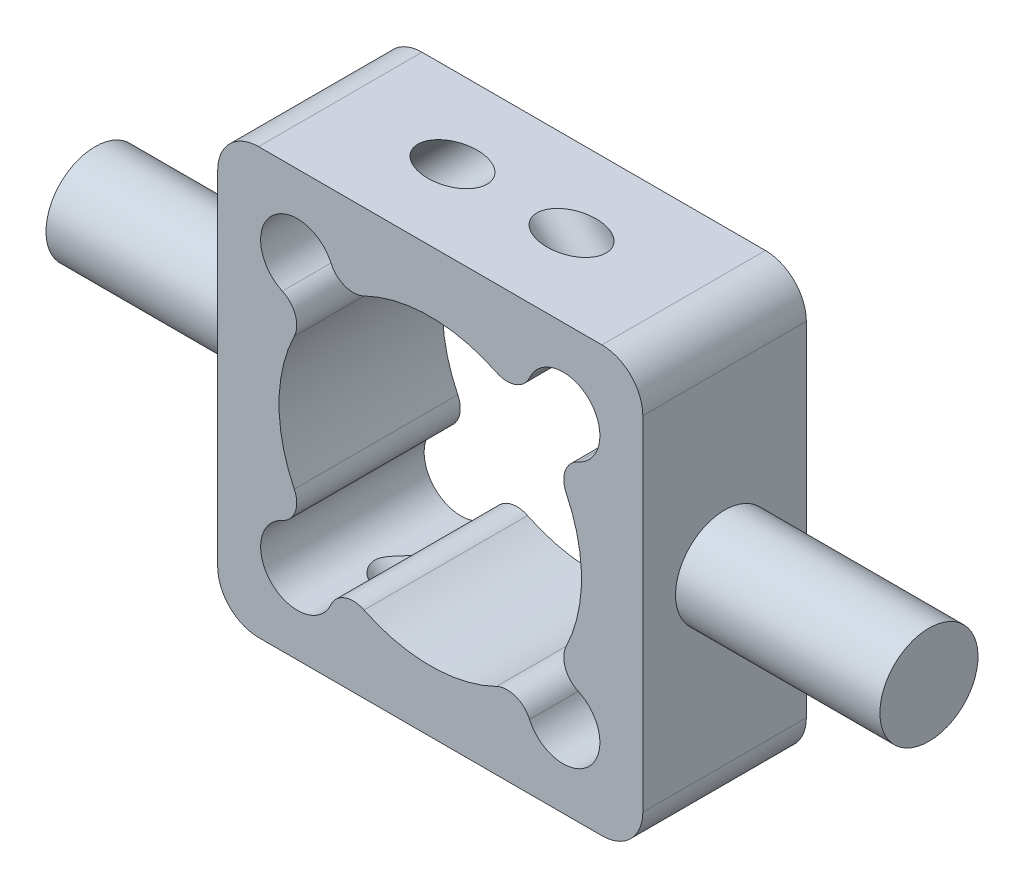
ISO-10303-21;
HEADER;
FILE_DESCRIPTION(('STEP AP214'),'2;1');
FILE_NAME('part.step','',(''),(''),'','','');
FILE_SCHEMA(('AUTOMOTIVE_DESIGN { 1 0 10303 214 1 1 1 1 }'));
ENDSEC;
DATA;
#1=APPLICATION_CONTEXT('core data for automotive mechanical design processes');
#2=APPLICATION_PROTOCOL_DEFINITION('international standard','automotive_design',2000,#1);
#3=PRODUCT_CONTEXT('',#1,'mechanical');
#4=PRODUCT('Part','Part','',(#3));
#5=PRODUCT_RELATED_PRODUCT_CATEGORY('part','',(#4));
#6=PRODUCT_DEFINITION_FORMATION('','',#4);
#7=PRODUCT_DEFINITION_CONTEXT('part definition',#1,'design');
#8=PRODUCT_DEFINITION('design','',#6,#7);
#9=PRODUCT_DEFINITION_SHAPE('','',#8);
#10=(LENGTH_UNIT() NAMED_UNIT(*) SI_UNIT(.MILLI.,.METRE.));
#11=(NAMED_UNIT(*) PLANE_ANGLE_UNIT() SI_UNIT($,.RADIAN.));
#12=(NAMED_UNIT(*) SI_UNIT($,.STERADIAN.) SOLID_ANGLE_UNIT());
#13=UNCERTAINTY_MEASURE_WITH_UNIT(LENGTH_MEASURE(1.E-05),#10,'distance_accuracy_value','');
#14=(GEOMETRIC_REPRESENTATION_CONTEXT(3) GLOBAL_UNCERTAINTY_ASSIGNED_CONTEXT((#13)) GLOBAL_UNIT_ASSIGNED_CONTEXT((#10,
#11,#12)) REPRESENTATION_CONTEXT('',''));
#15=CARTESIAN_POINT('',(0.,0.,0.));
#16=DIRECTION('',(0.,0.,1.));
#17=DIRECTION('',(1.,0.,0.));
#18=AXIS2_PLACEMENT_3D('',#15,#16,#17);
#19=CARTESIAN_POINT('',(-26.,-26.,20.));
#20=DIRECTION('',(0.,1.,0.));
#21=DIRECTION('',(-1.,0.,0.));
#22=AXIS2_PLACEMENT_3D('',#19,#20,#21);
#23=PLANE('',#22);
#24=DIRECTION('',(1.,0.,0.));
#25=VECTOR('',#24,1.);
#26=CARTESIAN_POINT('',(-26.,-26.,0.));
#27=LINE('',#26,#25);
#28=CARTESIAN_POINT('',(-21.,-26.,0.));
#29=VERTEX_POINT('',#28);
#30=CARTESIAN_POINT('',(21.,-26.,0.));
#31=VERTEX_POINT('',#30);
#32=EDGE_CURVE('E270',#29,#31,#27,.T.);
#33=ORIENTED_EDGE('',*,*,#32,.T.);
#34=DIRECTION('',(0.,0.,-1.));
#35=VECTOR('',#34,1.);
#36=CARTESIAN_POINT('',(21.,-26.,20.));
#37=LINE('',#36,#35);
#38=CARTESIAN_POINT('',(21.,-26.,20.));
#39=VERTEX_POINT('',#38);
#40=EDGE_CURVE('E309',#31,#39,#37,.F.);
#41=ORIENTED_EDGE('',*,*,#40,.T.);
#42=DIRECTION('',(1.,0.,0.));
#43=VECTOR('',#42,1.);
#44=CARTESIAN_POINT('',(-26.,-26.,20.));
#45=LINE('',#44,#43);
#46=CARTESIAN_POINT('',(-21.,-26.,20.));
#47=VERTEX_POINT('',#46);
#48=EDGE_CURVE('E257',#47,#39,#45,.T.);
#49=ORIENTED_EDGE('',*,*,#48,.F.);
#50=DIRECTION('',(0.,0.,-1.));
#51=VECTOR('',#50,1.);
#52=CARTESIAN_POINT('',(-21.,-26.,20.));
#53=LINE('',#52,#51);
#54=EDGE_CURVE('E306',#47,#29,#53,.T.);
#55=ORIENTED_EDGE('',*,*,#54,.T.);
#56=EDGE_LOOP('',(#33,#41,#49,#55));
#57=FACE_BOUND('',#56,.T.);
#58=CARTESIAN_POINT('',(7.28427124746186,-26.,10.));
#59=DIRECTION('',(0.,1.,0.));
#60=DIRECTION('',(-1.,0.,0.));
#61=AXIS2_PLACEMENT_3D('',#58,#59,#60);
#62=ELLIPSE('',#61,4.24264068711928,3.);
#63=CARTESIAN_POINT('',(3.04163056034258,-26.,10.));
#64=VERTEX_POINT('',#63);
#65=EDGE_CURVE('E398',#64,#64,#62,.T.);
#66=ORIENTED_EDGE('',*,*,#65,.T.);
#67=EDGE_LOOP('',(#66));
#68=FACE_BOUND('',#67,.T.);
#69=CARTESIAN_POINT('',(-7.28427124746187,-26.,10.));
#70=DIRECTION('',(0.,1.,0.));
#71=DIRECTION('',(1.,0.,0.));
#72=AXIS2_PLACEMENT_3D('',#69,#70,#71);
#73=ELLIPSE('',#72,4.24264068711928,3.);
#74=CARTESIAN_POINT('',(-3.04163056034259,-26.,10.));
#75=VERTEX_POINT('',#74);
#76=EDGE_CURVE('E229',#75,#75,#73,.F.);
#77=ORIENTED_EDGE('',*,*,#76,.F.);
#78=EDGE_LOOP('',(#77));
#79=FACE_BOUND('',#78,.T.);
#80=ADVANCED_FACE('F31',(#57,#68,#79),#23,.F.);
#81=CARTESIAN_POINT('',(-16.25,-16.25,20.));
#82=DIRECTION('',(0.,0.,-1.));
#83=DIRECTION('',(-1.,0.,0.));
#84=AXIS2_PLACEMENT_3D('',#81,#82,#83);
#85=CYLINDRICAL_SURFACE('',#84,4.5);
#86=DIRECTION('',(0.,0.,-1.));
#87=VECTOR('',#86,1.);
#88=CARTESIAN_POINT('',(-12.1470953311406,-18.0982892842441,20.));
#89=LINE('',#88,#87);
#90=CARTESIAN_POINT('',(-12.1470953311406,-18.0982892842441,20.));
#91=VERTEX_POINT('',#90);
#92=CARTESIAN_POINT('',(-12.1470953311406,-18.0982892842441,12.0934622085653));
#93=VERTEX_POINT('',#92);
#94=EDGE_CURVE('E228',#91,#93,#89,.T.);
#95=ORIENTED_EDGE('',*,*,#94,.T.);
#96=CARTESIAN_POINT('',(-12.1470953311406,-18.0982892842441,12.0934622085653));
#97=CARTESIAN_POINT('',(-12.1710761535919,-18.151524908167,12.1494987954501));
#98=CARTESIAN_POINT('',(-12.1969006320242,-18.2060803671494,12.2034585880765));
#99=CARTESIAN_POINT('',(-12.2525139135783,-18.3173601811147,12.3069894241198));
#100=CARTESIAN_POINT('',(-12.2823050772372,-18.3740858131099,12.3565578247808));
#101=CARTESIAN_POINT('',(-12.3782823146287,-18.5472245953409,12.4986458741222));
#102=CARTESIAN_POINT('',(-12.4508634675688,-18.6661167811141,12.5840445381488));
#103=CARTESIAN_POINT('',(-12.6144704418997,-18.9059380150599,12.7331929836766));
#104=CARTESIAN_POINT('',(-12.705571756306,-19.02687348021,12.7968512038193));
#105=CARTESIAN_POINT('',(-12.8552366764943,-19.2049310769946,12.8735724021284));
#106=CARTESIAN_POINT('',(-12.9072411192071,-19.2636745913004,12.8960066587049));
#107=CARTESIAN_POINT('',(-13.0153648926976,-19.379442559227,12.9344613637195));
#108=CARTESIAN_POINT('',(-13.0714838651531,-19.4364671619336,12.9504823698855));
#109=CARTESIAN_POINT('',(-13.2348396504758,-19.593662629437,12.9862954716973));
#110=CARTESIAN_POINT('',(-13.346475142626,-19.6911369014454,12.9985267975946));
#111=CARTESIAN_POINT('',(-13.5790259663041,-19.8746229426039,13.0012243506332));
#112=CARTESIAN_POINT('',(-13.6999468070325,-19.9606278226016,12.9916775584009));
#113=CARTESIAN_POINT('',(-13.9421617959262,-20.1157120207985,12.9529748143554));
#114=CARTESIAN_POINT('',(-14.0632402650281,-20.1853379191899,12.924633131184));
#115=CARTESIAN_POINT('',(-14.307079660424,-20.3112702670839,12.8510669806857));
#116=CARTESIAN_POINT('',(-14.4298406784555,-20.3675759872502,12.8058415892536));
#117=CARTESIAN_POINT('',(-14.6875574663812,-20.4725805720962,12.694840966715));
#118=CARTESIAN_POINT('',(-14.8223839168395,-20.5197812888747,12.6273631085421));
#119=CARTESIAN_POINT('',(-15.0875352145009,-20.5994693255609,12.4766943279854));
#120=CARTESIAN_POINT('',(-15.2178561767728,-20.631944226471,12.3934902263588));
#121=CARTESIAN_POINT('',(-15.4962444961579,-20.6891217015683,12.1954951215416));
#122=CARTESIAN_POINT('',(-15.6427546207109,-20.7110354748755,12.0777104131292));
#123=CARTESIAN_POINT('',(-15.9208951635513,-20.7401235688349,11.8239335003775));
#124=CARTESIAN_POINT('',(-16.0525162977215,-20.7472887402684,11.687930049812));
#125=CARTESIAN_POINT('',(-16.270386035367,-20.7510001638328,11.4266597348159));
#126=CARTESIAN_POINT('',(-16.3604566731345,-20.7493699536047,11.3046094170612));
#127=CARTESIAN_POINT('',(-16.5216111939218,-20.7425166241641,11.0486377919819));
#128=CARTESIAN_POINT('',(-16.5927353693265,-20.7373012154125,10.9147424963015));
#129=CARTESIAN_POINT('',(-16.6936277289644,-20.7282906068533,10.6718522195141));
#130=CARTESIAN_POINT('',(-16.7293327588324,-20.7244765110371,10.5653580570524));
#131=CARTESIAN_POINT('',(-16.7826946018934,-20.7184425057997,10.3479409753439));
#132=CARTESIAN_POINT('',(-16.8003843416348,-20.7162196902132,10.2370265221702));
#133=CARTESIAN_POINT('',(-16.8155037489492,-20.7143342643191,10.0131928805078));
#134=CARTESIAN_POINT('',(-16.8128322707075,-20.7146844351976,9.90026646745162));
#135=CARTESIAN_POINT('',(-16.7873763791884,-20.7178147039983,9.67670513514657));
#136=CARTESIAN_POINT('',(-16.7645678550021,-20.72059771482,9.56607312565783));
#137=CARTESIAN_POINT('',(-16.6942685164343,-20.7281830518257,9.32460664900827));
#138=CARTESIAN_POINT('',(-16.6422372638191,-20.7333062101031,9.19513357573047));
#139=CARTESIAN_POINT('',(-16.5183321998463,-20.7424192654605,8.94591894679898));
#140=CARTESIAN_POINT('',(-16.4464041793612,-20.7464060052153,8.82620515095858));
#141=CARTESIAN_POINT('',(-16.3095641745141,-20.7499780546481,8.62806680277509));
#142=CARTESIAN_POINT('',(-16.2480499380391,-20.7504645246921,8.54725705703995));
#143=CARTESIAN_POINT('',(-16.1187080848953,-20.7485491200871,8.39084431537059));
#144=CARTESIAN_POINT('',(-16.0508777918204,-20.7461460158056,8.31524355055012));
#145=CARTESIAN_POINT('',(-15.9099940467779,-20.7376917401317,8.16919632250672));
#146=CARTESIAN_POINT('',(-15.8369370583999,-20.7316380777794,8.09875341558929));
#147=CARTESIAN_POINT('',(-15.6865214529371,-20.7152254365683,7.9631494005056));
#148=CARTESIAN_POINT('',(-15.6091606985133,-20.7048643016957,7.8979909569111));
#149=CARTESIAN_POINT('',(-15.3683693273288,-20.6658144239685,7.70809076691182));
#150=CARTESIAN_POINT('',(-15.1991252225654,-20.6292726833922,7.59188391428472));
#151=CARTESIAN_POINT('',(-14.9391309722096,-20.5557834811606,7.43770999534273));
#152=CARTESIAN_POINT('',(-14.8514931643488,-20.5281939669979,7.38969496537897));
#153=CARTESIAN_POINT('',(-14.6748889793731,-20.466368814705,7.30094937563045));
#154=CARTESIAN_POINT('',(-14.5859230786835,-20.4321355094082,7.26021626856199));
#155=CARTESIAN_POINT('',(-14.3649041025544,-20.3386254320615,7.16921093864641));
#156=CARTESIAN_POINT('',(-14.232577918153,-20.2751987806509,7.12368257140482));
#157=CARTESIAN_POINT('',(-13.9708155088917,-20.1329724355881,7.05282790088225));
#158=CARTESIAN_POINT('',(-13.8413776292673,-20.0541818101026,7.02748972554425));
#159=CARTESIAN_POINT('',(-13.5888624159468,-19.8820493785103,6.99909791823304));
#160=CARTESIAN_POINT('',(-13.4658204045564,-19.7886362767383,6.99615717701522));
#161=CARTESIAN_POINT('',(-13.2310749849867,-19.590606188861,7.01395393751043));
#162=CARTESIAN_POINT('',(-13.1193645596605,-19.4859962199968,7.03467668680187));
#163=CARTESIAN_POINT('',(-12.9186354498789,-19.2784023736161,7.09671952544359));
#164=CARTESIAN_POINT('',(-12.8285216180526,-19.1759419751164,7.13628458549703));
#165=CARTESIAN_POINT('',(-12.6616240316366,-18.9686963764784,7.23374821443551));
#166=CARTESIAN_POINT('',(-12.5848628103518,-18.8639075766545,7.29167731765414));
#167=CARTESIAN_POINT('',(-12.4376018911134,-18.6447486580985,7.43102918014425));
#168=CARTESIAN_POINT('',(-12.3686057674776,-18.5305276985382,7.51428001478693));
#169=CARTESIAN_POINT('',(-12.2769882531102,-18.3640482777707,7.65213509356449));
#170=CARTESIAN_POINT('',(-12.248456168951,-18.3094275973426,7.70018332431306));
#171=CARTESIAN_POINT('',(-12.1950789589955,-18.2022271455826,7.80035713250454));
#172=CARTESIAN_POINT('',(-12.1702315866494,-18.1496461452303,7.85248019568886));
#173=CARTESIAN_POINT('',(-12.1470953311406,-18.0982892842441,7.90653779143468));
#174=B_SPLINE_CURVE_WITH_KNOTS('',3,(#96,#97,#98,#99,#100,#101,#102,#103,#104,#105,#106,#107,
#108,#109,#110,#111,#112,#113,#114,#115,#116,#117,#118,#119,#120,#121,#122,#123,#124,#125,#126,
#127,#128,#129,#130,#131,#132,#133,#134,#135,#136,#137,#138,#139,#140,#141,#142,#143,#144,#145,
#146,#147,#148,#149,#150,#151,#152,#153,#154,#155,#156,#157,#158,#159,#160,#161,#162,#163,#164,
#165,#166,#167,#168,#169,#170,#171,#172,#173),.UNSPECIFIED.,.F.,.F.,(4,2,2,2,2,2,2,2,2,2,2,2,2,
2,2,2,2,2,2,2,2,2,2,2,2,2,2,2,2,2,2,2,2,2,2,2,2,2,4),(0.,0.242669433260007,0.485483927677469,
0.973273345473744,1.46309249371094,1.70756200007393,1.95201024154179,2.39560342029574,
2.83946185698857,3.26524738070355,3.69105621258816,4.16327890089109,4.63589910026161,
5.20156420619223,5.76758011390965,6.22138700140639,6.67422095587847,7.01009583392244,
7.34535572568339,7.68228212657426,8.019612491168,8.43620826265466,8.85395043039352,
9.15826744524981,9.46271400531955,9.76736854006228,10.0721757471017,10.6940873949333,
11.004712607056,11.3152289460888,11.7741371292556,12.2327752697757,12.69372358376,
13.1543846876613,13.5786823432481,14.0036892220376,14.4733184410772,14.7075613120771,
14.941660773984),.UNSPECIFIED.);
#175=CARTESIAN_POINT('',(-12.1470953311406,-18.0982892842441,7.90653779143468));
#176=VERTEX_POINT('',#175);
#177=EDGE_CURVE('E50',#93,#176,#174,.T.);
#178=ORIENTED_EDGE('',*,*,#177,.T.);
#179=CARTESIAN_POINT('',(-12.1470953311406,-18.0982892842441,0.));
#180=VERTEX_POINT('',#179);
#181=EDGE_CURVE('E226',#176,#180,#89,.T.);
#182=ORIENTED_EDGE('',*,*,#181,.T.);
#183=CARTESIAN_POINT('',(-16.25,-16.25,0.));
#184=DIRECTION('',(0.,0.,1.));
#185=DIRECTION('',(1.,0.,0.));
#186=AXIS2_PLACEMENT_3D('',#183,#184,#185);
#187=CIRCLE('',#186,4.5);
#188=CARTESIAN_POINT('',(-18.0982892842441,-12.1470953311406,0.));
#189=VERTEX_POINT('',#188);
#190=EDGE_CURVE('E506',#189,#180,#187,.T.);
#191=ORIENTED_EDGE('',*,*,#190,.F.);
#192=DIRECTION('',(0.,0.,-1.));
#193=VECTOR('',#192,1.);
#194=CARTESIAN_POINT('',(-18.0982892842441,-12.1470953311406,20.));
#195=LINE('',#194,#193);
#196=CARTESIAN_POINT('',(-18.0982892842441,-12.1470953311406,20.));
#197=VERTEX_POINT('',#196);
#198=EDGE_CURVE('E237',#197,#189,#195,.T.);
#199=ORIENTED_EDGE('',*,*,#198,.F.);
#200=CARTESIAN_POINT('',(-16.25,-16.25,20.));
#201=DIRECTION('',(0.,0.,1.));
#202=DIRECTION('',(1.,0.,0.));
#203=AXIS2_PLACEMENT_3D('',#200,#201,#202);
#204=CIRCLE('',#203,4.5);
#205=EDGE_CURVE('E568',#197,#91,#204,.T.);
#206=ORIENTED_EDGE('',*,*,#205,.T.);
#207=EDGE_LOOP('',(#95,#178,#182,#191,#199,#206));
#208=FACE_BOUND('',#207,.T.);
#209=ADVANCED_FACE('F224',(#208),#85,.F.);
#210=CARTESIAN_POINT('',(-9.41182555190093,-19.3304821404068,20.));
#211=DIRECTION('',(0.,0.,-1.));
#212=DIRECTION('',(-1.,0.,0.));
#213=AXIS2_PLACEMENT_3D('',#210,#211,#212);
#214=CYLINDRICAL_SURFACE('',#213,3.);
#215=ORIENTED_EDGE('',*,*,#181,.F.);
#216=CARTESIAN_POINT('',(-12.1470953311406,-18.0982892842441,7.90653779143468));
#217=CARTESIAN_POINT('',(-12.123875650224,-18.0467503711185,7.9607642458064));
#218=CARTESIAN_POINT('',(-12.1001889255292,-17.9980538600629,8.01744208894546));
#219=CARTESIAN_POINT('',(-12.052774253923,-17.9063849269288,8.13515299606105));
#220=CARTESIAN_POINT('',(-12.0290463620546,-17.8634074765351,8.19618216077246));
#221=CARTESIAN_POINT('',(-11.9824952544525,-17.7832920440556,8.32188337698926));
#222=CARTESIAN_POINT('',(-11.9596686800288,-17.7461304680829,8.3865391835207));
#223=CARTESIAN_POINT('',(-11.9155567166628,-17.6773043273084,8.51920716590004));
#224=CARTESIAN_POINT('',(-11.8942716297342,-17.6456408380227,8.58721999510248));
#225=CARTESIAN_POINT('',(-11.8338511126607,-17.5588180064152,8.79515523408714));
#226=CARTESIAN_POINT('',(-11.79797929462,-17.5115504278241,8.93941763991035));
#227=CARTESIAN_POINT('',(-11.7390529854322,-17.4367277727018,9.23556724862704));
#228=CARTESIAN_POINT('',(-11.7160099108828,-17.409190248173,9.38746111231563));
#229=CARTESIAN_POINT('',(-11.6923847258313,-17.3813338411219,9.62258911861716));
#230=CARTESIAN_POINT('',(-11.6863364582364,-17.3743057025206,9.70456570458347));
#231=CARTESIAN_POINT('',(-11.6786628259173,-17.3654142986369,9.86899749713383));
#232=CARTESIAN_POINT('',(-11.6770361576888,-17.3635495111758,9.95145255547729));
#233=CARTESIAN_POINT('',(-11.6782581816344,-17.3649588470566,10.1163360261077));
#234=CARTESIAN_POINT('',(-11.6811098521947,-17.3682363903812,10.1987643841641));
#235=CARTESIAN_POINT('',(-11.6912070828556,-17.3799744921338,10.362950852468));
#236=CARTESIAN_POINT('',(-11.6984510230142,-17.3884331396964,10.444709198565));
#237=CARTESIAN_POINT('',(-11.7173174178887,-17.4108658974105,10.6087282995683));
#238=CARTESIAN_POINT('',(-11.7290285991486,-17.4249520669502,10.6909635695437));
#239=CARTESIAN_POINT('',(-11.7564452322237,-17.4587898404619,10.8535494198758));
#240=CARTESIAN_POINT('',(-11.7721491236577,-17.4785392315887,10.9339007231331));
#241=CARTESIAN_POINT('',(-11.8070442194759,-17.5238982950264,11.0920857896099));
#242=CARTESIAN_POINT('',(-11.8262326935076,-17.5495033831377,11.169921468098));
#243=CARTESIAN_POINT('',(-11.8674686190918,-17.6068052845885,11.3224926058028));
#244=CARTESIAN_POINT('',(-11.8895144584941,-17.6384986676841,11.3972297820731));
#245=CARTESIAN_POINT('',(-11.9307518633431,-17.7007314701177,11.5273793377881));
#246=CARTESIAN_POINT('',(-11.9495423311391,-17.73006206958,11.5835001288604));
#247=CARTESIAN_POINT('',(-11.9879852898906,-17.792707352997,11.6931480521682));
#248=CARTESIAN_POINT('',(-12.0076375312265,-17.8260208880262,11.7466759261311));
#249=CARTESIAN_POINT('',(-12.0473774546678,-17.8967752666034,11.8509599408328));
#250=CARTESIAN_POINT('',(-12.0674660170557,-17.9342252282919,11.9017095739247));
#251=CARTESIAN_POINT('',(-12.1075147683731,-18.0132043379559,12.0000451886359));
#252=CARTESIAN_POINT('',(-12.1274748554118,-18.0547363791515,12.0476288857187));
#253=CARTESIAN_POINT('',(-12.1470953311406,-18.0982892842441,12.0934622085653));
#254=B_SPLINE_CURVE_WITH_KNOTS('',3,(#216,#217,#218,#219,#220,#221,#222,#223,#224,#225,#226,
#227,#228,#229,#230,#231,#232,#233,#234,#235,#236,#237,#238,#239,#240,#241,#242,#243,#244,#245,
#246,#247,#248,#249,#250,#251,#252,#253),.UNSPECIFIED.,.F.,.F.,(4,2,2,2,2,2,2,2,2,2,2,2,2,2,2,2,
2,2,4),(0.,0.234856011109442,0.469504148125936,0.703174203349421,0.9368899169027,
1.40269360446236,1.868911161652,2.11616841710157,2.3633527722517,2.6107015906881,
2.85795923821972,3.1104076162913,3.36275748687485,3.61491047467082,3.86692180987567,
4.06491471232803,4.26285063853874,4.46123193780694,4.65975487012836),.UNSPECIFIED.);
#255=EDGE_CURVE('E11',#176,#93,#254,.T.);
#256=ORIENTED_EDGE('',*,*,#255,.T.);
#257=ORIENTED_EDGE('',*,*,#94,.F.);
#258=CARTESIAN_POINT('',(-9.41182555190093,-19.3304821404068,20.));
#259=DIRECTION('',(0.,0.,-1.));
#260=DIRECTION('',(1.,0.,0.));
#261=AXIS2_PLACEMENT_3D('',#258,#259,#260);
#262=CIRCLE('',#261,3.);
#263=CARTESIAN_POINT('',(-8.09854756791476,-16.6332055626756,20.));
#264=VERTEX_POINT('',#263);
#265=EDGE_CURVE('E575',#91,#264,#262,.T.);
#266=ORIENTED_EDGE('',*,*,#265,.T.);
#267=DIRECTION('',(0.,0.,-1.));
#268=VECTOR('',#267,1.);
#269=CARTESIAN_POINT('',(-8.09854756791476,-16.6332055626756,20.));
#270=LINE('',#269,#268);
#271=CARTESIAN_POINT('',(-8.09854756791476,-16.6332055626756,0.));
#272=VERTEX_POINT('',#271);
#273=EDGE_CURVE('E235',#264,#272,#270,.T.);
#274=ORIENTED_EDGE('',*,*,#273,.T.);
#275=CARTESIAN_POINT('',(-9.41182555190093,-19.3304821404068,0.));
#276=DIRECTION('',(0.,0.,-1.));
#277=DIRECTION('',(1.,0.,0.));
#278=AXIS2_PLACEMENT_3D('',#275,#276,#277);
#279=CIRCLE('',#278,3.);
#280=EDGE_CURVE('E233',#180,#272,#279,.T.);
#281=ORIENTED_EDGE('',*,*,#280,.F.);
#282=EDGE_LOOP('',(#215,#256,#257,#266,#274,#281));
#283=FACE_BOUND('',#282,.T.);
#284=ADVANCED_FACE('F231',(#283),#214,.T.);
#285=CARTESIAN_POINT('',(-26.,26.,20.));
#286=DIRECTION('',(0.,-1.,0.));
#287=DIRECTION('',(1.,0.,0.));
#288=AXIS2_PLACEMENT_3D('',#285,#286,#287);
#289=PLANE('',#288);
#290=CARTESIAN_POINT('',(-7.28427124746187,26.,10.));
#291=DIRECTION('',(0.,-1.,0.));
#292=DIRECTION('',(1.,0.,0.));
#293=AXIS2_PLACEMENT_3D('',#290,#291,#292);
#294=ELLIPSE('',#293,4.24264068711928,3.);
#295=CARTESIAN_POINT('',(-3.04163056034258,26.,10.));
#296=VERTEX_POINT('',#295);
#297=EDGE_CURVE('E354',#296,#296,#294,.T.);
#298=ORIENTED_EDGE('',*,*,#297,.T.);
#299=EDGE_LOOP('',(#298));
#300=FACE_BOUND('',#299,.T.);
#301=DIRECTION('',(-1.,0.,0.));
#302=VECTOR('',#301,1.);
#303=CARTESIAN_POINT('',(-26.,26.,20.));
#304=LINE('',#303,#302);
#305=CARTESIAN_POINT('',(21.,26.,20.));
#306=VERTEX_POINT('',#305);
#307=CARTESIAN_POINT('',(-21.,26.,20.));
#308=VERTEX_POINT('',#307);
#309=EDGE_CURVE('E264',#306,#308,#304,.T.);
#310=ORIENTED_EDGE('',*,*,#309,.F.);
#311=DIRECTION('',(0.,0.,-1.));
#312=VECTOR('',#311,1.);
#313=CARTESIAN_POINT('',(21.,26.,20.));
#314=LINE('',#313,#312);
#315=CARTESIAN_POINT('',(21.,26.,0.));
#316=VERTEX_POINT('',#315);
#317=EDGE_CURVE('E282',#306,#316,#314,.T.);
#318=ORIENTED_EDGE('',*,*,#317,.T.);
#319=DIRECTION('',(-1.,0.,0.));
#320=VECTOR('',#319,1.);
#321=CARTESIAN_POINT('',(-26.,26.,0.));
#322=LINE('',#321,#320);
#323=CARTESIAN_POINT('',(-21.,26.,0.));
#324=VERTEX_POINT('',#323);
#325=EDGE_CURVE('E258',#316,#324,#322,.T.);
#326=ORIENTED_EDGE('',*,*,#325,.T.);
#327=DIRECTION('',(0.,0.,-1.));
#328=VECTOR('',#327,1.);
#329=CARTESIAN_POINT('',(-21.,26.,20.));
#330=LINE('',#329,#328);
#331=EDGE_CURVE('E280',#324,#308,#330,.F.);
#332=ORIENTED_EDGE('',*,*,#331,.T.);
#333=EDGE_LOOP('',(#310,#318,#326,#332));
#334=FACE_BOUND('',#333,.T.);
#335=CARTESIAN_POINT('',(7.28427124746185,26.,10.));
#336=DIRECTION('',(0.,-1.,0.));
#337=DIRECTION('',(-1.,0.,0.));
#338=AXIS2_PLACEMENT_3D('',#335,#336,#337);
#339=ELLIPSE('',#338,4.24264068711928,3.);
#340=CARTESIAN_POINT('',(3.04163056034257,26.,10.));
#341=VERTEX_POINT('',#340);
#342=EDGE_CURVE('E353',#341,#341,#339,.F.);
#343=ORIENTED_EDGE('',*,*,#342,.F.);
#344=EDGE_LOOP('',(#343));
#345=FACE_BOUND('',#344,.T.);
#346=ADVANCED_FACE('F361',(#300,#334,#345),#289,.F.);
#347=CARTESIAN_POINT('',(16.25,16.25,20.));
#348=DIRECTION('',(0.,0.,-1.));
#349=DIRECTION('',(-1.,0.,0.));
#350=AXIS2_PLACEMENT_3D('',#347,#348,#349);
#351=CYLINDRICAL_SURFACE('',#350,4.5);
#352=DIRECTION('',(0.,0.,-1.));
#353=VECTOR('',#352,1.);
#354=CARTESIAN_POINT('',(12.1470953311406,18.0982892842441,20.));
#355=LINE('',#354,#353);
#356=CARTESIAN_POINT('',(12.1470953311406,18.0982892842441,20.));
#357=VERTEX_POINT('',#356);
#358=CARTESIAN_POINT('',(12.1470953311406,18.0982892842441,12.0934622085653));
#359=VERTEX_POINT('',#358);
#360=EDGE_CURVE('E539',#357,#359,#355,.T.);
#361=ORIENTED_EDGE('',*,*,#360,.T.);
#362=CARTESIAN_POINT('',(12.1470953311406,18.0982892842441,12.0934622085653));
#363=CARTESIAN_POINT('',(12.1710761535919,18.151524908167,12.1494987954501));
#364=CARTESIAN_POINT('',(12.1969006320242,18.2060803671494,12.2034585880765));
#365=CARTESIAN_POINT('',(12.2525139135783,18.3173601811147,12.3069894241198));
#366=CARTESIAN_POINT('',(12.2823050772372,18.3740858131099,12.3565578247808));
#367=CARTESIAN_POINT('',(12.3782823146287,18.5472245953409,12.4986458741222));
#368=CARTESIAN_POINT('',(12.4508634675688,18.6661167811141,12.5840445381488));
#369=CARTESIAN_POINT('',(12.6144704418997,18.9059380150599,12.7331929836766));
#370=CARTESIAN_POINT('',(12.705571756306,19.02687348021,12.7968512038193));
#371=CARTESIAN_POINT('',(12.8552366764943,19.2049310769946,12.8735724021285));
#372=CARTESIAN_POINT('',(12.9072411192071,19.2636745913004,12.8960066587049));
#373=CARTESIAN_POINT('',(13.0153648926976,19.379442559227,12.9344613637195));
#374=CARTESIAN_POINT('',(13.0714838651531,19.4364671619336,12.9504823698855));
#375=CARTESIAN_POINT('',(13.2348396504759,19.593662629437,12.9862954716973));
#376=CARTESIAN_POINT('',(13.346475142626,19.6911369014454,12.9985267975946));
#377=CARTESIAN_POINT('',(13.5790259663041,19.8746229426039,13.0012243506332));
#378=CARTESIAN_POINT('',(13.6999468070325,19.9606278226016,12.9916775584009));
#379=CARTESIAN_POINT('',(13.9421617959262,20.1157120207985,12.9529748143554));
#380=CARTESIAN_POINT('',(14.0632402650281,20.1853379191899,12.924633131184));
#381=CARTESIAN_POINT('',(14.307079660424,20.3112702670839,12.8510669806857));
#382=CARTESIAN_POINT('',(14.4298406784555,20.3675759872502,12.8058415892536));
#383=CARTESIAN_POINT('',(14.6875574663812,20.4725805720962,12.694840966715));
#384=CARTESIAN_POINT('',(14.8223839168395,20.5197812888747,12.6273631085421));
#385=CARTESIAN_POINT('',(15.0875352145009,20.5994693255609,12.4766943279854));
#386=CARTESIAN_POINT('',(15.2178561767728,20.631944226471,12.3934902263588));
#387=CARTESIAN_POINT('',(15.4962444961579,20.6891217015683,12.1954951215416));
#388=CARTESIAN_POINT('',(15.6427546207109,20.7110354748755,12.0777104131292));
#389=CARTESIAN_POINT('',(15.9208951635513,20.7401235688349,11.8239335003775));
#390=CARTESIAN_POINT('',(16.0525162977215,20.7472887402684,11.687930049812));
#391=CARTESIAN_POINT('',(16.270386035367,20.7510001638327,11.4266597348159));
#392=CARTESIAN_POINT('',(16.3604566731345,20.7493699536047,11.3046094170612));
#393=CARTESIAN_POINT('',(16.5216111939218,20.7425166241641,11.0486377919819));
#394=CARTESIAN_POINT('',(16.5927353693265,20.7373012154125,10.9147424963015));
#395=CARTESIAN_POINT('',(16.6936277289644,20.7282906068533,10.6718522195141));
#396=CARTESIAN_POINT('',(16.7293327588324,20.7244765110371,10.5653580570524));
#397=CARTESIAN_POINT('',(16.7826946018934,20.7184425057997,10.3479409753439));
#398=CARTESIAN_POINT('',(16.8003843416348,20.7162196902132,10.2370265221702));
#399=CARTESIAN_POINT('',(16.8155037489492,20.7143342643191,10.0131928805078));
#400=CARTESIAN_POINT('',(16.8128322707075,20.7146844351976,9.90026646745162));
#401=CARTESIAN_POINT('',(16.7873763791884,20.7178147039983,9.67670513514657));
#402=CARTESIAN_POINT('',(16.7645678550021,20.72059771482,9.56607312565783));
#403=CARTESIAN_POINT('',(16.6942685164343,20.7281830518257,9.32460664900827));
#404=CARTESIAN_POINT('',(16.6422372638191,20.7333062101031,9.19513357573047));
#405=CARTESIAN_POINT('',(16.5183321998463,20.7424192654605,8.94591894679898));
#406=CARTESIAN_POINT('',(16.4464041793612,20.7464060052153,8.82620515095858));
#407=CARTESIAN_POINT('',(16.3095641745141,20.7499780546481,8.62806680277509));
#408=CARTESIAN_POINT('',(16.2480499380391,20.7504645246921,8.54725705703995));
#409=CARTESIAN_POINT('',(16.1187080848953,20.7485491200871,8.39084431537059));
#410=CARTESIAN_POINT('',(16.0508777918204,20.7461460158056,8.31524355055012));
#411=CARTESIAN_POINT('',(15.9099940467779,20.7376917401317,8.16919632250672));
#412=CARTESIAN_POINT('',(15.8369370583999,20.7316380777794,8.09875341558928));
#413=CARTESIAN_POINT('',(15.6865214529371,20.7152254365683,7.9631494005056));
#414=CARTESIAN_POINT('',(15.6091606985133,20.7048643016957,7.8979909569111));
#415=CARTESIAN_POINT('',(15.3683693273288,20.6658144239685,7.70809076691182));
#416=CARTESIAN_POINT('',(15.1991252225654,20.6292726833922,7.59188391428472));
#417=CARTESIAN_POINT('',(14.9391309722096,20.5557834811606,7.43770999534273));
#418=CARTESIAN_POINT('',(14.8514931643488,20.5281939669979,7.38969496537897));
#419=CARTESIAN_POINT('',(14.6748889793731,20.466368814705,7.30094937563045));
#420=CARTESIAN_POINT('',(14.5859230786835,20.4321355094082,7.26021626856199));
#421=CARTESIAN_POINT('',(14.3649041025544,20.3386254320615,7.16921093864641));
#422=CARTESIAN_POINT('',(14.232577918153,20.2751987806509,7.12368257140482));
#423=CARTESIAN_POINT('',(13.9708155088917,20.1329724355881,7.05282790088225));
#424=CARTESIAN_POINT('',(13.8413776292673,20.0541818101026,7.02748972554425));
#425=CARTESIAN_POINT('',(13.5888624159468,19.8820493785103,6.99909791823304));
#426=CARTESIAN_POINT('',(13.4658204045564,19.7886362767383,6.99615717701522));
#427=CARTESIAN_POINT('',(13.2310749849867,19.590606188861,7.01395393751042));
#428=CARTESIAN_POINT('',(13.1193645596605,19.4859962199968,7.03467668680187));
#429=CARTESIAN_POINT('',(12.9186354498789,19.2784023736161,7.09671952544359));
#430=CARTESIAN_POINT('',(12.8285216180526,19.1759419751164,7.13628458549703));
#431=CARTESIAN_POINT('',(12.6616240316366,18.9686963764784,7.23374821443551));
#432=CARTESIAN_POINT('',(12.5848628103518,18.8639075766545,7.29167731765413));
#433=CARTESIAN_POINT('',(12.4376018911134,18.6447486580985,7.43102918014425));
#434=CARTESIAN_POINT('',(12.3686057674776,18.5305276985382,7.51428001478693));
#435=CARTESIAN_POINT('',(12.2769882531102,18.3640482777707,7.65213509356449));
#436=CARTESIAN_POINT('',(12.248456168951,18.3094275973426,7.70018332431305));
#437=CARTESIAN_POINT('',(12.1950789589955,18.2022271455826,7.80035713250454));
#438=CARTESIAN_POINT('',(12.1702315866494,18.1496461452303,7.85248019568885));
#439=CARTESIAN_POINT('',(12.1470953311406,18.0982892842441,7.90653779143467));
#440=B_SPLINE_CURVE_WITH_KNOTS('',3,(#362,#363,#364,#365,#366,#367,#368,#369,#370,#371,#372,
#373,#374,#375,#376,#377,#378,#379,#380,#381,#382,#383,#384,#385,#386,#387,#388,#389,#390,#391,
#392,#393,#394,#395,#396,#397,#398,#399,#400,#401,#402,#403,#404,#405,#406,#407,#408,#409,#410,
#411,#412,#413,#414,#415,#416,#417,#418,#419,#420,#421,#422,#423,#424,#425,#426,#427,#428,#429,
#430,#431,#432,#433,#434,#435,#436,#437,#438,#439),.UNSPECIFIED.,.F.,.F.,(4,2,2,2,2,2,2,2,2,2,2,
2,2,2,2,2,2,2,2,2,2,2,2,2,2,2,2,2,2,2,2,2,2,2,2,2,2,2,4),(0.,0.242669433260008,
0.485483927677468,0.973273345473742,1.46309249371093,1.70756200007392,1.95201024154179,
2.39560342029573,2.83946185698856,3.26524738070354,3.69105621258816,4.16327890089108,
4.63589910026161,5.20156420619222,5.76758011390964,6.22138700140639,6.67422095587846,
7.01009583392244,7.34535572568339,7.68228212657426,8.01961249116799,8.43620826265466,
8.85395043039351,9.15826744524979,9.46271400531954,9.76736854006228,10.0721757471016,
10.6940873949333,11.004712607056,11.3152289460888,11.7741371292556,12.2327752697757,
12.69372358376,13.1543846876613,13.5786823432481,14.0036892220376,14.4733184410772,
14.707561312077,14.941660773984),.UNSPECIFIED.);
#441=CARTESIAN_POINT('',(12.1470953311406,18.0982892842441,7.90653779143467));
#442=VERTEX_POINT('',#441);
#443=EDGE_CURVE('E346',#359,#442,#440,.T.);
#444=ORIENTED_EDGE('',*,*,#443,.T.);
#445=CARTESIAN_POINT('',(12.1470953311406,18.0982892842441,0.));
#446=VERTEX_POINT('',#445);
#447=EDGE_CURVE('E538',#442,#446,#355,.T.);
#448=ORIENTED_EDGE('',*,*,#447,.T.);
#449=CARTESIAN_POINT('',(16.25,16.25,0.));
#450=DIRECTION('',(0.,0.,1.));
#451=DIRECTION('',(1.,0.,0.));
#452=AXIS2_PLACEMENT_3D('',#449,#450,#451);
#453=CIRCLE('',#452,4.5);
#454=CARTESIAN_POINT('',(18.0982892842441,12.1470953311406,0.));
#455=VERTEX_POINT('',#454);
#456=EDGE_CURVE('E527',#455,#446,#453,.T.);
#457=ORIENTED_EDGE('',*,*,#456,.F.);
#458=DIRECTION('',(0.,0.,-1.));
#459=VECTOR('',#458,1.);
#460=CARTESIAN_POINT('',(18.0982892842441,12.1470953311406,20.));
#461=LINE('',#460,#459);
#462=CARTESIAN_POINT('',(18.0982892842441,12.1470953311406,20.));
#463=VERTEX_POINT('',#462);
#464=EDGE_CURVE('E542',#463,#455,#461,.T.);
#465=ORIENTED_EDGE('',*,*,#464,.F.);
#466=CARTESIAN_POINT('',(16.25,16.25,20.));
#467=DIRECTION('',(0.,0.,1.));
#468=DIRECTION('',(1.,0.,0.));
#469=AXIS2_PLACEMENT_3D('',#466,#467,#468);
#470=CIRCLE('',#469,4.5);
#471=EDGE_CURVE('E593',#463,#357,#470,.T.);
#472=ORIENTED_EDGE('',*,*,#471,.T.);
#473=EDGE_LOOP('',(#361,#444,#448,#457,#465,#472));
#474=FACE_BOUND('',#473,.T.);
#475=ADVANCED_FACE('F357',(#474),#351,.F.);
#476=CARTESIAN_POINT('',(9.41182555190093,19.3304821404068,20.));
#477=DIRECTION('',(0.,0.,-1.));
#478=DIRECTION('',(-1.,0.,0.));
#479=AXIS2_PLACEMENT_3D('',#476,#477,#478);
#480=CYLINDRICAL_SURFACE('',#479,3.);
#481=ORIENTED_EDGE('',*,*,#447,.F.);
#482=CARTESIAN_POINT('',(12.1470953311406,18.0982892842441,7.90653779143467));
#483=CARTESIAN_POINT('',(12.123875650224,18.0467503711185,7.96076424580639));
#484=CARTESIAN_POINT('',(12.1001889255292,17.9980538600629,8.01744208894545));
#485=CARTESIAN_POINT('',(12.052774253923,17.9063849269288,8.13515299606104));
#486=CARTESIAN_POINT('',(12.0290463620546,17.8634074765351,8.19618216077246));
#487=CARTESIAN_POINT('',(11.9824952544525,17.7832920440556,8.32188337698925));
#488=CARTESIAN_POINT('',(11.9596686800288,17.7461304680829,8.38653918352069));
#489=CARTESIAN_POINT('',(11.9155567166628,17.6773043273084,8.51920716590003));
#490=CARTESIAN_POINT('',(11.8942716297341,17.6456408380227,8.58721999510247));
#491=CARTESIAN_POINT('',(11.8338511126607,17.5588180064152,8.79515523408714));
#492=CARTESIAN_POINT('',(11.79797929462,17.5115504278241,8.93941763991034));
#493=CARTESIAN_POINT('',(11.7390529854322,17.4367277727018,9.23556724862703));
#494=CARTESIAN_POINT('',(11.7160099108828,17.409190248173,9.38746111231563));
#495=CARTESIAN_POINT('',(11.6923847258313,17.3813338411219,9.62258911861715));
#496=CARTESIAN_POINT('',(11.6863364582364,17.3743057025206,9.70456570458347));
#497=CARTESIAN_POINT('',(11.6786628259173,17.3654142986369,9.86899749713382));
#498=CARTESIAN_POINT('',(11.6770361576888,17.3635495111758,9.95145255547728));
#499=CARTESIAN_POINT('',(11.6782581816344,17.3649588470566,10.1163360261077));
#500=CARTESIAN_POINT('',(11.6811098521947,17.3682363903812,10.1987643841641));
#501=CARTESIAN_POINT('',(11.6912070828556,17.3799744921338,10.362950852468));
#502=CARTESIAN_POINT('',(11.6984510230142,17.3884331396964,10.444709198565));
#503=CARTESIAN_POINT('',(11.7173174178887,17.4108658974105,10.6087282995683));
#504=CARTESIAN_POINT('',(11.7290285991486,17.4249520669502,10.6909635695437));
#505=CARTESIAN_POINT('',(11.7564452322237,17.4587898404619,10.8535494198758));
#506=CARTESIAN_POINT('',(11.7721491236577,17.4785392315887,10.933900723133));
#507=CARTESIAN_POINT('',(11.8070442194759,17.5238982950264,11.0920857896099));
#508=CARTESIAN_POINT('',(11.8262326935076,17.5495033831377,11.169921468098));
#509=CARTESIAN_POINT('',(11.8674686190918,17.6068052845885,11.3224926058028));
#510=CARTESIAN_POINT('',(11.8895144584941,17.6384986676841,11.3972297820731));
#511=CARTESIAN_POINT('',(11.9307518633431,17.7007314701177,11.5273793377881));
#512=CARTESIAN_POINT('',(11.9495423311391,17.73006206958,11.5835001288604));
#513=CARTESIAN_POINT('',(11.9879852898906,17.792707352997,11.6931480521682));
#514=CARTESIAN_POINT('',(12.0076375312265,17.8260208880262,11.7466759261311));
#515=CARTESIAN_POINT('',(12.0473774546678,17.8967752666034,11.8509599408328));
#516=CARTESIAN_POINT('',(12.0674660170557,17.9342252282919,11.9017095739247));
#517=CARTESIAN_POINT('',(12.1075147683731,18.0132043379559,12.0000451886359));
#518=CARTESIAN_POINT('',(12.1274748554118,18.0547363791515,12.0476288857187));
#519=CARTESIAN_POINT('',(12.1470953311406,18.0982892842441,12.0934622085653));
#520=B_SPLINE_CURVE_WITH_KNOTS('',3,(#482,#483,#484,#485,#486,#487,#488,#489,#490,#491,#492,
#493,#494,#495,#496,#497,#498,#499,#500,#501,#502,#503,#504,#505,#506,#507,#508,#509,#510,#511,
#512,#513,#514,#515,#516,#517,#518,#519),.UNSPECIFIED.,.F.,.F.,(4,2,2,2,2,2,2,2,2,2,2,2,2,2,2,2,
2,2,4),(0.,0.234856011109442,0.469504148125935,0.70317420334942,0.936889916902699,
1.40269360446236,1.868911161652,2.11616841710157,2.3633527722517,2.6107015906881,
2.85795923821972,3.1104076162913,3.36275748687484,3.61491047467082,3.86692180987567,
4.06491471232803,4.26285063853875,4.46123193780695,4.65975487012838),.UNSPECIFIED.);
#521=EDGE_CURVE('E316',#442,#359,#520,.T.);
#522=ORIENTED_EDGE('',*,*,#521,.T.);
#523=ORIENTED_EDGE('',*,*,#360,.F.);
#524=CARTESIAN_POINT('',(9.41182555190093,19.3304821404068,20.));
#525=DIRECTION('',(0.,0.,-1.));
#526=DIRECTION('',(1.,0.,0.));
#527=AXIS2_PLACEMENT_3D('',#524,#525,#526);
#528=CIRCLE('',#527,3.);
#529=CARTESIAN_POINT('',(8.09854756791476,16.6332055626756,20.));
#530=VERTEX_POINT('',#529);
#531=EDGE_CURVE('E594',#357,#530,#528,.T.);
#532=ORIENTED_EDGE('',*,*,#531,.T.);
#533=DIRECTION('',(0.,0.,-1.));
#534=VECTOR('',#533,1.);
#535=CARTESIAN_POINT('',(8.09854756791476,16.6332055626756,20.));
#536=LINE('',#535,#534);
#537=CARTESIAN_POINT('',(8.09854756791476,16.6332055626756,0.));
#538=VERTEX_POINT('',#537);
#539=EDGE_CURVE('E536',#530,#538,#536,.T.);
#540=ORIENTED_EDGE('',*,*,#539,.T.);
#541=CARTESIAN_POINT('',(9.41182555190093,19.3304821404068,0.));
#542=DIRECTION('',(0.,0.,-1.));
#543=DIRECTION('',(1.,0.,0.));
#544=AXIS2_PLACEMENT_3D('',#541,#542,#543);
#545=CIRCLE('',#544,3.);
#546=EDGE_CURVE('E530',#446,#538,#545,.T.);
#547=ORIENTED_EDGE('',*,*,#546,.F.);
#548=EDGE_LOOP('',(#481,#522,#523,#532,#540,#547));
#549=FACE_BOUND('',#548,.T.);
#550=ADVANCED_FACE('F330',(#549),#480,.T.);
#551=CARTESIAN_POINT('',(-26.,26.,20.));
#552=DIRECTION('',(1.,0.,0.));
#553=DIRECTION('',(0.,1.,0.));
#554=AXIS2_PLACEMENT_3D('',#551,#552,#553);
#555=PLANE('',#554);
#556=DIRECTION('',(0.,-1.,0.));
#557=VECTOR('',#556,1.);
#558=CARTESIAN_POINT('',(-26.,26.,0.));
#559=LINE('',#558,#557);
#560=CARTESIAN_POINT('',(-26.,21.,0.));
#561=VERTEX_POINT('',#560);
#562=CARTESIAN_POINT('',(-26.,-21.,0.));
#563=VERTEX_POINT('',#562);
#564=EDGE_CURVE('E253',#561,#563,#559,.T.);
#565=ORIENTED_EDGE('',*,*,#564,.T.);
#566=DIRECTION('',(0.,0.,-1.));
#567=VECTOR('',#566,1.);
#568=CARTESIAN_POINT('',(-26.,-21.,20.));
#569=LINE('',#568,#567);
#570=CARTESIAN_POINT('',(-26.,-21.,20.));
#571=VERTEX_POINT('',#570);
#572=EDGE_CURVE('E314',#563,#571,#569,.F.);
#573=ORIENTED_EDGE('',*,*,#572,.T.);
#574=DIRECTION('',(0.,-1.,0.));
#575=VECTOR('',#574,1.);
#576=CARTESIAN_POINT('',(-26.,26.,20.));
#577=LINE('',#576,#575);
#578=CARTESIAN_POINT('',(-26.,21.,20.));
#579=VERTEX_POINT('',#578);
#580=EDGE_CURVE('E254',#579,#571,#577,.T.);
#581=ORIENTED_EDGE('',*,*,#580,.F.);
#582=DIRECTION('',(0.,0.,-1.));
#583=VECTOR('',#582,1.);
#584=CARTESIAN_POINT('',(-26.,21.,20.));
#585=LINE('',#584,#583);
#586=EDGE_CURVE('E311',#579,#561,#585,.T.);
#587=ORIENTED_EDGE('',*,*,#586,.T.);
#588=EDGE_LOOP('',(#565,#573,#581,#587));
#589=FACE_BOUND('',#588,.T.);
#590=CARTESIAN_POINT('',(-26.,0.,10.));
#591=DIRECTION('',(1.,0.,0.));
#592=DIRECTION('',(0.,1.,0.));
#593=AXIS2_PLACEMENT_3D('',#590,#591,#592);
#594=CIRCLE('',#593,6.);
#595=CARTESIAN_POINT('',(-26.,6.,10.));
#596=VERTEX_POINT('',#595);
#597=EDGE_CURVE('E267',#596,#596,#594,.F.);
#598=ORIENTED_EDGE('',*,*,#597,.F.);
#599=EDGE_LOOP('',(#598));
#600=FACE_BOUND('',#599,.T.);
#601=ADVANCED_FACE('F418',(#589,#600),#555,.F.);
#602=CARTESIAN_POINT('',(-26.,-26.,20.));
#603=DIRECTION('',(0.,0.,1.));
#604=DIRECTION('',(1.,0.,0.));
#605=AXIS2_PLACEMENT_3D('',#602,#603,#604);
#606=PLANE('',#605);
#607=DIRECTION('',(0.,1.,0.));
#608=VECTOR('',#607,1.);
#609=CARTESIAN_POINT('',(26.,26.,20.));
#610=LINE('',#609,#608);
#611=CARTESIAN_POINT('',(26.,-21.,20.));
#612=VERTEX_POINT('',#611);
#613=CARTESIAN_POINT('',(26.,21.,20.));
#614=VERTEX_POINT('',#613);
#615=EDGE_CURVE('E261',#612,#614,#610,.T.);
#616=ORIENTED_EDGE('',*,*,#615,.T.);
#617=CARTESIAN_POINT('',(21.,21.,20.));
#618=DIRECTION('',(0.,0.,1.));
#619=DIRECTION('',(1.,0.,0.));
#620=AXIS2_PLACEMENT_3D('',#617,#618,#619);
#621=CIRCLE('',#620,5.);
#622=EDGE_CURVE('E304',#614,#306,#621,.T.);
#623=ORIENTED_EDGE('',*,*,#622,.T.);
#624=ORIENTED_EDGE('',*,*,#309,.T.);
#625=CARTESIAN_POINT('',(-21.,21.,20.));
#626=DIRECTION('',(0.,0.,1.));
#627=DIRECTION('',(1.,0.,0.));
#628=AXIS2_PLACEMENT_3D('',#625,#626,#627);
#629=CIRCLE('',#628,5.);
#630=EDGE_CURVE('E298',#308,#579,#629,.T.);
#631=ORIENTED_EDGE('',*,*,#630,.T.);
#632=ORIENTED_EDGE('',*,*,#580,.T.);
#633=CARTESIAN_POINT('',(-21.,-21.,20.));
#634=DIRECTION('',(0.,0.,1.));
#635=DIRECTION('',(1.,0.,0.));
#636=AXIS2_PLACEMENT_3D('',#633,#634,#635);
#637=CIRCLE('',#636,5.);
#638=EDGE_CURVE('E300',#571,#47,#637,.T.);
#639=ORIENTED_EDGE('',*,*,#638,.T.);
#640=ORIENTED_EDGE('',*,*,#48,.T.);
#641=CARTESIAN_POINT('',(21.,-21.,20.));
#642=DIRECTION('',(0.,0.,1.));
#643=DIRECTION('',(1.,0.,0.));
#644=AXIS2_PLACEMENT_3D('',#641,#642,#643);
#645=CIRCLE('',#644,5.);
#646=EDGE_CURVE('E302',#39,#612,#645,.T.);
#647=ORIENTED_EDGE('',*,*,#646,.T.);
#648=EDGE_LOOP('',(#616,#623,#624,#631,#632,#639,#640,#647));
#649=FACE_BOUND('',#648,.T.);
#650=CARTESIAN_POINT('',(-16.25,16.25,20.));
#651=DIRECTION('',(0.,0.,1.));
#652=DIRECTION('',(1.,0.,0.));
#653=AXIS2_PLACEMENT_3D('',#650,#651,#652);
#654=CIRCLE('',#653,4.5);
#655=CARTESIAN_POINT('',(-12.1470953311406,18.0982892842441,20.));
#656=VERTEX_POINT('',#655);
#657=CARTESIAN_POINT('',(-18.0982892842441,12.1470953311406,20.));
#658=VERTEX_POINT('',#657);
#659=EDGE_CURVE('E605',#656,#658,#654,.T.);
#660=ORIENTED_EDGE('',*,*,#659,.F.);
#661=CARTESIAN_POINT('',(-9.41182555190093,19.3304821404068,20.));
#662=DIRECTION('',(0.,0.,-1.));
#663=DIRECTION('',(1.,0.,0.));
#664=AXIS2_PLACEMENT_3D('',#661,#662,#663);
#665=CIRCLE('',#664,3.);
#666=CARTESIAN_POINT('',(-8.09854756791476,16.6332055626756,20.));
#667=VERTEX_POINT('',#666);
#668=EDGE_CURVE('E533',#667,#656,#665,.T.);
#669=ORIENTED_EDGE('',*,*,#668,.F.);
#670=CARTESIAN_POINT('',(0.,0.,20.));
#671=DIRECTION('',(0.,0.,1.));
#672=DIRECTION('',(1.,0.,0.));
#673=AXIS2_PLACEMENT_3D('',#670,#671,#672);
#674=CIRCLE('',#673,18.5);
#675=EDGE_CURVE('E496',#530,#667,#674,.T.);
#676=ORIENTED_EDGE('',*,*,#675,.F.);
#677=ORIENTED_EDGE('',*,*,#531,.F.);
#678=ORIENTED_EDGE('',*,*,#471,.F.);
#679=CARTESIAN_POINT('',(19.3304821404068,9.41182555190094,20.));
#680=DIRECTION('',(0.,0.,-1.));
#681=DIRECTION('',(-1.,0.,0.));
#682=AXIS2_PLACEMENT_3D('',#679,#680,#681);
#683=CIRCLE('',#682,3.);
#684=CARTESIAN_POINT('',(16.6332055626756,8.09854756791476,20.));
#685=VERTEX_POINT('',#684);
#686=EDGE_CURVE('E591',#685,#463,#683,.T.);
#687=ORIENTED_EDGE('',*,*,#686,.F.);
#688=CARTESIAN_POINT('',(0.,0.,20.));
#689=DIRECTION('',(0.,0.,1.));
#690=DIRECTION('',(1.,0.,0.));
#691=AXIS2_PLACEMENT_3D('',#688,#689,#690);
#692=CIRCLE('',#691,18.5);
#693=CARTESIAN_POINT('',(16.6332055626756,-8.09854756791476,20.));
#694=VERTEX_POINT('',#693);
#695=EDGE_CURVE('E589',#694,#685,#692,.T.);
#696=ORIENTED_EDGE('',*,*,#695,.F.);
#697=CARTESIAN_POINT('',(19.3304821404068,-9.41182555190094,20.));
#698=DIRECTION('',(0.,0.,-1.));
#699=DIRECTION('',(1.,0.,0.));
#700=AXIS2_PLACEMENT_3D('',#697,#698,#699);
#701=CIRCLE('',#700,3.);
#702=CARTESIAN_POINT('',(18.0982892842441,-12.1470953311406,20.));
#703=VERTEX_POINT('',#702);
#704=EDGE_CURVE('E587',#703,#694,#701,.T.);
#705=ORIENTED_EDGE('',*,*,#704,.F.);
#706=CARTESIAN_POINT('',(16.25,-16.25,20.));
#707=DIRECTION('',(0.,0.,1.));
#708=DIRECTION('',(1.,0.,0.));
#709=AXIS2_PLACEMENT_3D('',#706,#707,#708);
#710=CIRCLE('',#709,4.5);
#711=CARTESIAN_POINT('',(12.1470953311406,-18.0982892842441,20.));
#712=VERTEX_POINT('',#711);
#713=EDGE_CURVE('E585',#712,#703,#710,.T.);
#714=ORIENTED_EDGE('',*,*,#713,.F.);
#715=CARTESIAN_POINT('',(9.41182555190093,-19.3304821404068,20.));
#716=DIRECTION('',(0.,0.,-1.));
#717=DIRECTION('',(-1.,0.,0.));
#718=AXIS2_PLACEMENT_3D('',#715,#716,#717);
#719=CIRCLE('',#718,3.);
#720=CARTESIAN_POINT('',(8.09854756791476,-16.6332055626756,20.));
#721=VERTEX_POINT('',#720);
#722=EDGE_CURVE('E583',#721,#712,#719,.T.);
#723=ORIENTED_EDGE('',*,*,#722,.F.);
#724=CARTESIAN_POINT('',(0.,0.,20.));
#725=DIRECTION('',(0.,0.,1.));
#726=DIRECTION('',(1.,0.,0.));
#727=AXIS2_PLACEMENT_3D('',#724,#725,#726);
#728=CIRCLE('',#727,18.5);
#729=EDGE_CURVE('E560',#264,#721,#728,.T.);
#730=ORIENTED_EDGE('',*,*,#729,.F.);
#731=ORIENTED_EDGE('',*,*,#265,.F.);
#732=ORIENTED_EDGE('',*,*,#205,.F.);
#733=CARTESIAN_POINT('',(-19.3304821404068,-9.41182555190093,20.));
#734=DIRECTION('',(0.,0.,-1.));
#735=DIRECTION('',(1.,0.,0.));
#736=AXIS2_PLACEMENT_3D('',#733,#734,#735);
#737=CIRCLE('',#736,3.);
#738=CARTESIAN_POINT('',(-16.6332055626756,-8.09854756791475,20.));
#739=VERTEX_POINT('',#738);
#740=EDGE_CURVE('E574',#739,#197,#737,.T.);
#741=ORIENTED_EDGE('',*,*,#740,.F.);
#742=CARTESIAN_POINT('',(0.,0.,20.));
#743=DIRECTION('',(0.,0.,1.));
#744=DIRECTION('',(1.,0.,0.));
#745=AXIS2_PLACEMENT_3D('',#742,#743,#744);
#746=CIRCLE('',#745,18.5);
#747=CARTESIAN_POINT('',(-16.6332055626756,8.09854756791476,20.));
#748=VERTEX_POINT('',#747);
#749=EDGE_CURVE('E578',#748,#739,#746,.T.);
#750=ORIENTED_EDGE('',*,*,#749,.F.);
#751=CARTESIAN_POINT('',(-19.3304821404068,9.41182555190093,20.));
#752=DIRECTION('',(0.,0.,-1.));
#753=DIRECTION('',(1.,0.,0.));
#754=AXIS2_PLACEMENT_3D('',#751,#752,#753);
#755=CIRCLE('',#754,3.);
#756=EDGE_CURVE('E607',#658,#748,#755,.T.);
#757=ORIENTED_EDGE('',*,*,#756,.F.);
#758=EDGE_LOOP('',(#660,#669,#676,#677,#678,#687,#696,#705,#714,#723,#730,#731,#732,#741,#750,#757));
#759=FACE_BOUND('',#758,.T.);
#760=ADVANCED_FACE('F414',(#649,#759),#606,.T.);
#761=CARTESIAN_POINT('',(-26.,-26.,0.));
#762=DIRECTION('',(0.,0.,1.));
#763=DIRECTION('',(1.,0.,0.));
#764=AXIS2_PLACEMENT_3D('',#761,#762,#763);
#765=PLANE('',#764);
#766=ORIENTED_EDGE('',*,*,#325,.F.);
#767=CARTESIAN_POINT('',(21.,21.,0.));
#768=DIRECTION('',(0.,0.,1.));
#769=DIRECTION('',(1.,0.,0.));
#770=AXIS2_PLACEMENT_3D('',#767,#768,#769);
#771=CIRCLE('',#770,5.);
#772=CARTESIAN_POINT('',(26.,21.,0.));
#773=VERTEX_POINT('',#772);
#774=EDGE_CURVE('E291',#316,#773,#771,.F.);
#775=ORIENTED_EDGE('',*,*,#774,.T.);
#776=DIRECTION('',(0.,1.,0.));
#777=VECTOR('',#776,1.);
#778=CARTESIAN_POINT('',(26.,26.,0.));
#779=LINE('',#778,#777);
#780=CARTESIAN_POINT('',(26.,-21.,0.));
#781=VERTEX_POINT('',#780);
#782=EDGE_CURVE('E273',#781,#773,#779,.T.);
#783=ORIENTED_EDGE('',*,*,#782,.F.);
#784=CARTESIAN_POINT('',(21.,-21.,0.));
#785=DIRECTION('',(0.,0.,1.));
#786=DIRECTION('',(1.,0.,0.));
#787=AXIS2_PLACEMENT_3D('',#784,#785,#786);
#788=CIRCLE('',#787,5.);
#789=EDGE_CURVE('E289',#781,#31,#788,.F.);
#790=ORIENTED_EDGE('',*,*,#789,.T.);
#791=ORIENTED_EDGE('',*,*,#32,.F.);
#792=CARTESIAN_POINT('',(-21.,-21.,0.));
#793=DIRECTION('',(0.,0.,1.));
#794=DIRECTION('',(1.,0.,0.));
#795=AXIS2_PLACEMENT_3D('',#792,#793,#794);
#796=CIRCLE('',#795,5.);
#797=EDGE_CURVE('E287',#29,#563,#796,.F.);
#798=ORIENTED_EDGE('',*,*,#797,.T.);
#799=ORIENTED_EDGE('',*,*,#564,.F.);
#800=CARTESIAN_POINT('',(-21.,21.,0.));
#801=DIRECTION('',(0.,0.,1.));
#802=DIRECTION('',(1.,0.,0.));
#803=AXIS2_PLACEMENT_3D('',#800,#801,#802);
#804=CIRCLE('',#803,5.);
#805=EDGE_CURVE('E285',#561,#324,#804,.F.);
#806=ORIENTED_EDGE('',*,*,#805,.T.);
#807=EDGE_LOOP('',(#766,#775,#783,#790,#791,#798,#799,#806));
#808=FACE_BOUND('',#807,.T.);
#809=CARTESIAN_POINT('',(-9.41182555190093,19.3304821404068,0.));
#810=DIRECTION('',(0.,0.,-1.));
#811=DIRECTION('',(1.,0.,0.));
#812=AXIS2_PLACEMENT_3D('',#809,#810,#811);
#813=CIRCLE('',#812,3.);
#814=CARTESIAN_POINT('',(-8.09854756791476,16.6332055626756,0.));
#815=VERTEX_POINT('',#814);
#816=CARTESIAN_POINT('',(-12.1470953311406,18.0982892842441,0.));
#817=VERTEX_POINT('',#816);
#818=EDGE_CURVE('E479',#815,#817,#813,.T.);
#819=ORIENTED_EDGE('',*,*,#818,.T.);
#820=CARTESIAN_POINT('',(-16.25,16.25,0.));
#821=DIRECTION('',(0.,0.,1.));
#822=DIRECTION('',(1.,0.,0.));
#823=AXIS2_PLACEMENT_3D('',#820,#821,#822);
#824=CIRCLE('',#823,4.5);
#825=CARTESIAN_POINT('',(-18.0982892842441,12.1470953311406,0.));
#826=VERTEX_POINT('',#825);
#827=EDGE_CURVE('E482',#817,#826,#824,.T.);
#828=ORIENTED_EDGE('',*,*,#827,.T.);
#829=CARTESIAN_POINT('',(-19.3304821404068,9.41182555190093,0.));
#830=DIRECTION('',(0.,0.,-1.));
#831=DIRECTION('',(1.,0.,0.));
#832=AXIS2_PLACEMENT_3D('',#829,#830,#831);
#833=CIRCLE('',#832,3.);
#834=CARTESIAN_POINT('',(-16.6332055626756,8.09854756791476,0.));
#835=VERTEX_POINT('',#834);
#836=EDGE_CURVE('E490',#826,#835,#833,.T.);
#837=ORIENTED_EDGE('',*,*,#836,.T.);
#838=CARTESIAN_POINT('',(0.,0.,0.));
#839=DIRECTION('',(0.,0.,1.));
#840=DIRECTION('',(1.,0.,0.));
#841=AXIS2_PLACEMENT_3D('',#838,#839,#840);
#842=CIRCLE('',#841,18.5);
#843=CARTESIAN_POINT('',(-16.6332055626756,-8.09854756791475,0.));
#844=VERTEX_POINT('',#843);
#845=EDGE_CURVE('E500',#835,#844,#842,.T.);
#846=ORIENTED_EDGE('',*,*,#845,.T.);
#847=CARTESIAN_POINT('',(-19.3304821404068,-9.41182555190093,0.));
#848=DIRECTION('',(0.,0.,-1.));
#849=DIRECTION('',(1.,0.,0.));
#850=AXIS2_PLACEMENT_3D('',#847,#848,#849);
#851=CIRCLE('',#850,3.);
#852=EDGE_CURVE('E503',#844,#189,#851,.T.);
#853=ORIENTED_EDGE('',*,*,#852,.T.);
#854=ORIENTED_EDGE('',*,*,#190,.T.);
#855=ORIENTED_EDGE('',*,*,#280,.T.);
#856=CARTESIAN_POINT('',(0.,0.,0.));
#857=DIRECTION('',(0.,0.,1.));
#858=DIRECTION('',(1.,0.,0.));
#859=AXIS2_PLACEMENT_3D('',#856,#857,#858);
#860=CIRCLE('',#859,18.5);
#861=CARTESIAN_POINT('',(8.09854756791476,-16.6332055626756,0.));
#862=VERTEX_POINT('',#861);
#863=EDGE_CURVE('E509',#272,#862,#860,.T.);
#864=ORIENTED_EDGE('',*,*,#863,.T.);
#865=CARTESIAN_POINT('',(9.41182555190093,-19.3304821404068,0.));
#866=DIRECTION('',(0.,0.,-1.));
#867=DIRECTION('',(-1.,0.,0.));
#868=AXIS2_PLACEMENT_3D('',#865,#866,#867);
#869=CIRCLE('',#868,3.);
#870=CARTESIAN_POINT('',(12.1470953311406,-18.0982892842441,0.));
#871=VERTEX_POINT('',#870);
#872=EDGE_CURVE('E512',#862,#871,#869,.T.);
#873=ORIENTED_EDGE('',*,*,#872,.T.);
#874=CARTESIAN_POINT('',(16.25,-16.25,0.));
#875=DIRECTION('',(0.,0.,1.));
#876=DIRECTION('',(1.,0.,0.));
#877=AXIS2_PLACEMENT_3D('',#874,#875,#876);
#878=CIRCLE('',#877,4.5);
#879=CARTESIAN_POINT('',(18.0982892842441,-12.1470953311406,0.));
#880=VERTEX_POINT('',#879);
#881=EDGE_CURVE('E515',#871,#880,#878,.T.);
#882=ORIENTED_EDGE('',*,*,#881,.T.);
#883=CARTESIAN_POINT('',(19.3304821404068,-9.41182555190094,0.));
#884=DIRECTION('',(0.,0.,-1.));
#885=DIRECTION('',(1.,0.,0.));
#886=AXIS2_PLACEMENT_3D('',#883,#884,#885);
#887=CIRCLE('',#886,3.);
#888=CARTESIAN_POINT('',(16.6332055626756,-8.09854756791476,0.));
#889=VERTEX_POINT('',#888);
#890=EDGE_CURVE('E518',#880,#889,#887,.T.);
#891=ORIENTED_EDGE('',*,*,#890,.T.);
#892=CARTESIAN_POINT('',(0.,0.,0.));
#893=DIRECTION('',(0.,0.,1.));
#894=DIRECTION('',(1.,0.,0.));
#895=AXIS2_PLACEMENT_3D('',#892,#893,#894);
#896=CIRCLE('',#895,18.5);
#897=CARTESIAN_POINT('',(16.6332055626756,8.09854756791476,0.));
#898=VERTEX_POINT('',#897);
#899=EDGE_CURVE('E521',#889,#898,#896,.T.);
#900=ORIENTED_EDGE('',*,*,#899,.T.);
#901=CARTESIAN_POINT('',(19.3304821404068,9.41182555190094,0.));
#902=DIRECTION('',(0.,0.,-1.));
#903=DIRECTION('',(-1.,0.,0.));
#904=AXIS2_PLACEMENT_3D('',#901,#902,#903);
#905=CIRCLE('',#904,3.);
#906=EDGE_CURVE('E524',#898,#455,#905,.T.);
#907=ORIENTED_EDGE('',*,*,#906,.T.);
#908=ORIENTED_EDGE('',*,*,#456,.T.);
#909=ORIENTED_EDGE('',*,*,#546,.T.);
#910=CARTESIAN_POINT('',(0.,0.,0.));
#911=DIRECTION('',(0.,0.,1.));
#912=DIRECTION('',(1.,0.,0.));
#913=AXIS2_PLACEMENT_3D('',#910,#911,#912);
#914=CIRCLE('',#913,18.5);
#915=EDGE_CURVE('E485',#538,#815,#914,.T.);
#916=ORIENTED_EDGE('',*,*,#915,.T.);
#917=EDGE_LOOP('',(#819,#828,#837,#846,#853,#854,#855,#864,#873,#882,#891,#900,#907,#908,#909,#916));
#918=FACE_BOUND('',#917,.T.);
#919=ADVANCED_FACE('F417',(#808,#918),#765,.F.);
#920=CARTESIAN_POINT('',(26.,26.,20.));
#921=DIRECTION('',(-1.,0.,0.));
#922=DIRECTION('',(0.,-1.,0.));
#923=AXIS2_PLACEMENT_3D('',#920,#921,#922);
#924=PLANE('',#923);
#925=CARTESIAN_POINT('',(26.,0.,10.));
#926=DIRECTION('',(-1.,0.,0.));
#927=DIRECTION('',(0.,-1.,0.));
#928=AXIS2_PLACEMENT_3D('',#925,#926,#927);
#929=CIRCLE('',#928,6.);
#930=CARTESIAN_POINT('',(26.,-6.,10.));
#931=VERTEX_POINT('',#930);
#932=EDGE_CURVE('E870',#931,#931,#929,.T.);
#933=ORIENTED_EDGE('',*,*,#932,.T.);
#934=EDGE_LOOP('',(#933));
#935=FACE_BOUND('',#934,.T.);
#936=ORIENTED_EDGE('',*,*,#782,.T.);
#937=DIRECTION('',(0.,0.,-1.));
#938=VECTOR('',#937,1.);
#939=CARTESIAN_POINT('',(26.,21.,20.));
#940=LINE('',#939,#938);
#941=EDGE_CURVE('E296',#773,#614,#940,.F.);
#942=ORIENTED_EDGE('',*,*,#941,.T.);
#943=ORIENTED_EDGE('',*,*,#615,.F.);
#944=DIRECTION('',(0.,0.,-1.));
#945=VECTOR('',#944,1.);
#946=CARTESIAN_POINT('',(26.,-21.,20.));
#947=LINE('',#946,#945);
#948=EDGE_CURVE('E293',#612,#781,#947,.T.);
#949=ORIENTED_EDGE('',*,*,#948,.T.);
#950=EDGE_LOOP('',(#936,#942,#943,#949));
#951=FACE_BOUND('',#950,.T.);
#952=ADVANCED_FACE('F410',(#935,#951),#924,.F.);
#953=CARTESIAN_POINT('',(-9.41182555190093,19.3304821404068,20.));
#954=DIRECTION('',(0.,0.,-1.));
#955=DIRECTION('',(-1.,0.,0.));
#956=AXIS2_PLACEMENT_3D('',#953,#954,#955);
#957=CYLINDRICAL_SURFACE('',#956,3.);
#958=CARTESIAN_POINT('',(-12.1470953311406,18.0982892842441,7.90653779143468));
#959=CARTESIAN_POINT('',(-12.123875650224,18.0467503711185,7.9607642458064));
#960=CARTESIAN_POINT('',(-12.1001889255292,17.9980538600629,8.01744208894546));
#961=CARTESIAN_POINT('',(-12.052774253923,17.9063849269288,8.13515299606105));
#962=CARTESIAN_POINT('',(-12.0290463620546,17.8634074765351,8.19618216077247));
#963=CARTESIAN_POINT('',(-11.9824952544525,17.7832920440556,8.32188337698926));
#964=CARTESIAN_POINT('',(-11.9596686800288,17.7461304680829,8.38653918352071));
#965=CARTESIAN_POINT('',(-11.9155567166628,17.6773043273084,8.51920716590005));
#966=CARTESIAN_POINT('',(-11.8942716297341,17.6456408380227,8.58721999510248));
#967=CARTESIAN_POINT('',(-11.8338511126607,17.5588180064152,8.79515523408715));
#968=CARTESIAN_POINT('',(-11.79797929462,17.5115504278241,8.93941763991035));
#969=CARTESIAN_POINT('',(-11.7390529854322,17.4367277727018,9.23556724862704));
#970=CARTESIAN_POINT('',(-11.7160099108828,17.409190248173,9.38746111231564));
#971=CARTESIAN_POINT('',(-11.6923847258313,17.3813338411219,9.62258911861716));
#972=CARTESIAN_POINT('',(-11.6863364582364,17.3743057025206,9.70456570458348));
#973=CARTESIAN_POINT('',(-11.6786628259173,17.3654142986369,9.86899749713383));
#974=CARTESIAN_POINT('',(-11.6770361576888,17.3635495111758,9.95145255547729));
#975=CARTESIAN_POINT('',(-11.6782581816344,17.3649588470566,10.1163360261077));
#976=CARTESIAN_POINT('',(-11.6811098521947,17.3682363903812,10.1987643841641));
#977=CARTESIAN_POINT('',(-11.6912070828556,17.3799744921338,10.362950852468));
#978=CARTESIAN_POINT('',(-11.6984510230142,17.3884331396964,10.444709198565));
#979=CARTESIAN_POINT('',(-11.7173174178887,17.4108658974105,10.6087282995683));
#980=CARTESIAN_POINT('',(-11.7290285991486,17.4249520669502,10.6909635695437));
#981=CARTESIAN_POINT('',(-11.7564452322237,17.4587898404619,10.8535494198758));
#982=CARTESIAN_POINT('',(-11.7721491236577,17.4785392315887,10.9339007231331));
#983=CARTESIAN_POINT('',(-11.8070442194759,17.5238982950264,11.0920857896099));
#984=CARTESIAN_POINT('',(-11.8262326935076,17.5495033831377,11.169921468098));
#985=CARTESIAN_POINT('',(-11.8674686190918,17.6068052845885,11.3224926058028));
#986=CARTESIAN_POINT('',(-11.8895144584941,17.6384986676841,11.3972297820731));
#987=CARTESIAN_POINT('',(-11.9307518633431,17.7007314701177,11.5273793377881));
#988=CARTESIAN_POINT('',(-11.9495423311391,17.73006206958,11.5835001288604));
#989=CARTESIAN_POINT('',(-11.9879852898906,17.792707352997,11.6931480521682));
#990=CARTESIAN_POINT('',(-12.0076375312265,17.8260208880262,11.7466759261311));
#991=CARTESIAN_POINT('',(-12.0473774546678,17.8967752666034,11.8509599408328));
#992=CARTESIAN_POINT('',(-12.0674660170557,17.9342252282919,11.9017095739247));
#993=CARTESIAN_POINT('',(-12.1075147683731,18.0132043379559,12.0000451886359));
#994=CARTESIAN_POINT('',(-12.1274748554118,18.0547363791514,12.0476288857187));
#995=CARTESIAN_POINT('',(-12.1470953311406,18.0982892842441,12.0934622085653));
#996=B_SPLINE_CURVE_WITH_KNOTS('',3,(#958,#959,#960,#961,#962,#963,#964,#965,#966,#967,#968,
#969,#970,#971,#972,#973,#974,#975,#976,#977,#978,#979,#980,#981,#982,#983,#984,#985,#986,#987,
#988,#989,#990,#991,#992,#993,#994,#995),.UNSPECIFIED.,.F.,.F.,(4,2,2,2,2,2,2,2,2,2,2,2,2,2,2,2,
2,2,4),(0.,0.234856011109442,0.469504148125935,0.70317420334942,0.936889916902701,
1.40269360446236,1.868911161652,2.11616841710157,2.36335277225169,2.6107015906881,
2.85795923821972,3.1104076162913,3.36275748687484,3.61491047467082,3.86692180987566,
4.06491471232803,4.26285063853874,4.46123193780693,4.65975487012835),.UNSPECIFIED.);
#997=CARTESIAN_POINT('',(-12.1470953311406,18.098289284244,7.90653779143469));
#998=VERTEX_POINT('',#997);
#999=CARTESIAN_POINT('',(-12.1470953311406,18.0982892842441,12.0934622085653));
#1000=VERTEX_POINT('',#999);
#1001=EDGE_CURVE('E400',#998,#1000,#996,.T.);
#1002=ORIENTED_EDGE('',*,*,#1001,.F.);
#1003=DIRECTION('',(0.,0.,-1.));
#1004=VECTOR('',#1003,1.);
#1005=CARTESIAN_POINT('',(-12.1470953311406,18.0982892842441,20.));
#1006=LINE('',#1005,#1004);
#1007=EDGE_CURVE('E249',#998,#817,#1006,.T.);
#1008=ORIENTED_EDGE('',*,*,#1007,.T.);
#1009=ORIENTED_EDGE('',*,*,#818,.F.);
#1010=DIRECTION('',(0.,0.,-1.));
#1011=VECTOR('',#1010,1.);
#1012=CARTESIAN_POINT('',(-8.09854756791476,16.6332055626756,20.));
#1013=LINE('',#1012,#1011);
#1014=EDGE_CURVE('E534',#667,#815,#1013,.T.);
#1015=ORIENTED_EDGE('',*,*,#1014,.F.);
#1016=ORIENTED_EDGE('',*,*,#668,.T.);
#1017=EDGE_CURVE('E250',#656,#1000,#1006,.T.);
#1018=ORIENTED_EDGE('',*,*,#1017,.T.);
#1019=EDGE_LOOP('',(#1002,#1008,#1009,#1015,#1016,#1018));
#1020=FACE_BOUND('',#1019,.T.);
#1021=ADVANCED_FACE('F405',(#1020),#957,.T.);
#1022=CARTESIAN_POINT('',(-16.25,16.25,20.));
#1023=DIRECTION('',(0.,0.,-1.));
#1024=DIRECTION('',(-1.,0.,0.));
#1025=AXIS2_PLACEMENT_3D('',#1022,#1023,#1024);
#1026=CYLINDRICAL_SURFACE('',#1025,4.5);
#1027=CARTESIAN_POINT('',(-12.1470953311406,18.098289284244,12.0934622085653));
#1028=CARTESIAN_POINT('',(-12.1710761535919,18.151524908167,12.1494987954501));
#1029=CARTESIAN_POINT('',(-12.1969006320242,18.2060803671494,12.2034585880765));
#1030=CARTESIAN_POINT('',(-12.2525139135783,18.3173601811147,12.3069894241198));
#1031=CARTESIAN_POINT('',(-12.2823050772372,18.3740858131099,12.3565578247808));
#1032=CARTESIAN_POINT('',(-12.3782823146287,18.5472245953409,12.4986458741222));
#1033=CARTESIAN_POINT('',(-12.4508634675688,18.6661167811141,12.5840445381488));
#1034=CARTESIAN_POINT('',(-12.6144704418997,18.9059380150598,12.7331929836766));
#1035=CARTESIAN_POINT('',(-12.705571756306,19.02687348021,12.7968512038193));
#1036=CARTESIAN_POINT('',(-12.8552366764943,19.2049310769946,12.8735724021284));
#1037=CARTESIAN_POINT('',(-12.9072411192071,19.2636745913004,12.8960066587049));
#1038=CARTESIAN_POINT('',(-13.0153648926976,19.3794425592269,12.9344613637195));
#1039=CARTESIAN_POINT('',(-13.0714838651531,19.4364671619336,12.9504823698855));
#1040=CARTESIAN_POINT('',(-13.2348396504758,19.593662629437,12.9862954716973));
#1041=CARTESIAN_POINT('',(-13.346475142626,19.6911369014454,12.9985267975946));
#1042=CARTESIAN_POINT('',(-13.5790259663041,19.8746229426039,13.0012243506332));
#1043=CARTESIAN_POINT('',(-13.6999468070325,19.9606278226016,12.9916775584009));
#1044=CARTESIAN_POINT('',(-13.9421617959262,20.1157120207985,12.9529748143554));
#1045=CARTESIAN_POINT('',(-14.0632402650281,20.1853379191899,12.924633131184));
#1046=CARTESIAN_POINT('',(-14.307079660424,20.3112702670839,12.8510669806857));
#1047=CARTESIAN_POINT('',(-14.4298406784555,20.3675759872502,12.8058415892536));
#1048=CARTESIAN_POINT('',(-14.6875574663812,20.4725805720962,12.694840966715));
#1049=CARTESIAN_POINT('',(-14.8223839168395,20.5197812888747,12.6273631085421));
#1050=CARTESIAN_POINT('',(-15.0875352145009,20.5994693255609,12.4766943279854));
#1051=CARTESIAN_POINT('',(-15.2178561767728,20.631944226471,12.3934902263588));
#1052=CARTESIAN_POINT('',(-15.4962444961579,20.6891217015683,12.1954951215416));
#1053=CARTESIAN_POINT('',(-15.6427546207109,20.7110354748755,12.0777104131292));
#1054=CARTESIAN_POINT('',(-15.9208951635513,20.7401235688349,11.8239335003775));
#1055=CARTESIAN_POINT('',(-16.0525162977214,20.7472887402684,11.687930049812));
#1056=CARTESIAN_POINT('',(-16.270386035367,20.7510001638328,11.4266597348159));
#1057=CARTESIAN_POINT('',(-16.3604566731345,20.7493699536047,11.3046094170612));
#1058=CARTESIAN_POINT('',(-16.5216111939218,20.7425166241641,11.0486377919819));
#1059=CARTESIAN_POINT('',(-16.5927353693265,20.7373012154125,10.9147424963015));
#1060=CARTESIAN_POINT('',(-16.6936277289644,20.7282906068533,10.6718522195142));
#1061=CARTESIAN_POINT('',(-16.7293327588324,20.7244765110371,10.5653580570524));
#1062=CARTESIAN_POINT('',(-16.7826946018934,20.7184425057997,10.3479409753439));
#1063=CARTESIAN_POINT('',(-16.8003843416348,20.7162196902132,10.2370265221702));
#1064=CARTESIAN_POINT('',(-16.8155037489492,20.7143342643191,10.0131928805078));
#1065=CARTESIAN_POINT('',(-16.8128322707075,20.7146844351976,9.90026646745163));
#1066=CARTESIAN_POINT('',(-16.7873763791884,20.7178147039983,9.67670513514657));
#1067=CARTESIAN_POINT('',(-16.7645678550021,20.72059771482,9.56607312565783));
#1068=CARTESIAN_POINT('',(-16.6942685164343,20.7281830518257,9.32460664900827));
#1069=CARTESIAN_POINT('',(-16.6422372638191,20.7333062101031,9.19513357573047));
#1070=CARTESIAN_POINT('',(-16.5183321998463,20.7424192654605,8.94591894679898));
#1071=CARTESIAN_POINT('',(-16.4464041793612,20.7464060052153,8.82620515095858));
#1072=CARTESIAN_POINT('',(-16.3095641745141,20.7499780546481,8.6280668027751));
#1073=CARTESIAN_POINT('',(-16.2480499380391,20.7504645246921,8.54725705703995));
#1074=CARTESIAN_POINT('',(-16.1187080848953,20.7485491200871,8.39084431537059));
#1075=CARTESIAN_POINT('',(-16.0508777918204,20.7461460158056,8.31524355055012));
#1076=CARTESIAN_POINT('',(-15.9099940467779,20.7376917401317,8.16919632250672));
#1077=CARTESIAN_POINT('',(-15.8369370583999,20.7316380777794,8.09875341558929));
#1078=CARTESIAN_POINT('',(-15.6865214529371,20.7152254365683,7.96314940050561));
#1079=CARTESIAN_POINT('',(-15.6091606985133,20.7048643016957,7.89799095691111));
#1080=CARTESIAN_POINT('',(-15.3683693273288,20.6658144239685,7.70809076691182));
#1081=CARTESIAN_POINT('',(-15.1991252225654,20.6292726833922,7.59188391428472));
#1082=CARTESIAN_POINT('',(-14.9391309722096,20.5557834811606,7.43770999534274));
#1083=CARTESIAN_POINT('',(-14.8514931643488,20.5281939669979,7.38969496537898));
#1084=CARTESIAN_POINT('',(-14.6748889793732,20.466368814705,7.30094937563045));
#1085=CARTESIAN_POINT('',(-14.5859230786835,20.4321355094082,7.26021626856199));
#1086=CARTESIAN_POINT('',(-14.3649041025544,20.3386254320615,7.16921093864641));
#1087=CARTESIAN_POINT('',(-14.232577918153,20.2751987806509,7.12368257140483));
#1088=CARTESIAN_POINT('',(-13.9708155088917,20.1329724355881,7.05282790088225));
#1089=CARTESIAN_POINT('',(-13.8413776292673,20.0541818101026,7.02748972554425));
#1090=CARTESIAN_POINT('',(-13.5888624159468,19.8820493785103,6.99909791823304));
#1091=CARTESIAN_POINT('',(-13.4658204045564,19.7886362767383,6.99615717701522));
#1092=CARTESIAN_POINT('',(-13.2310749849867,19.590606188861,7.01395393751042));
#1093=CARTESIAN_POINT('',(-13.1193645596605,19.4859962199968,7.03467668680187));
#1094=CARTESIAN_POINT('',(-12.9186354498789,19.2784023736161,7.09671952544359));
#1095=CARTESIAN_POINT('',(-12.8285216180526,19.1759419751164,7.13628458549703));
#1096=CARTESIAN_POINT('',(-12.6616240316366,18.9686963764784,7.23374821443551));
#1097=CARTESIAN_POINT('',(-12.5848628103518,18.8639075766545,7.29167731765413));
#1098=CARTESIAN_POINT('',(-12.4376018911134,18.6447486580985,7.43102918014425));
#1099=CARTESIAN_POINT('',(-12.3686057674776,18.5305276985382,7.51428001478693));
#1100=CARTESIAN_POINT('',(-12.2769882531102,18.3640482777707,7.65213509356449));
#1101=CARTESIAN_POINT('',(-12.248456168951,18.3094275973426,7.70018332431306));
#1102=CARTESIAN_POINT('',(-12.1950789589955,18.2022271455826,7.80035713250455));
#1103=CARTESIAN_POINT('',(-12.1702315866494,18.1496461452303,7.85248019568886));
#1104=CARTESIAN_POINT('',(-12.1470953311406,18.098289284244,7.90653779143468));
#1105=B_SPLINE_CURVE_WITH_KNOTS('',3,(#1027,#1028,#1029,#1030,#1031,#1032,#1033,#1034,#1035,
#1036,#1037,#1038,#1039,#1040,#1041,#1042,#1043,#1044,#1045,#1046,#1047,#1048,#1049,#1050,#1051,
#1052,#1053,#1054,#1055,#1056,#1057,#1058,#1059,#1060,#1061,#1062,#1063,#1064,#1065,#1066,#1067,
#1068,#1069,#1070,#1071,#1072,#1073,#1074,#1075,#1076,#1077,#1078,#1079,#1080,#1081,#1082,#1083,
#1084,#1085,#1086,#1087,#1088,#1089,#1090,#1091,#1092,#1093,#1094,#1095,#1096,#1097,#1098,#1099,
#1100,#1101,#1102,#1103,#1104),.UNSPECIFIED.,.F.,.F.,(4,2,2,2,2,2,2,2,2,2,2,2,2,2,2,2,2,2,2,2,2,
2,2,2,2,2,2,2,2,2,2,2,2,2,2,2,2,2,4),(0.,0.242669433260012,0.485483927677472,0.973273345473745,
1.46309249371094,1.70756200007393,1.9520102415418,2.39560342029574,2.83946185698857,
3.26524738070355,3.69105621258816,4.16327890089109,4.63589910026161,5.20156420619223,
5.76758011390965,6.22138700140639,6.67422095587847,7.01009583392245,7.3453557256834,
7.68228212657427,8.01961249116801,8.43620826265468,8.85395043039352,9.15826744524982,
9.46271400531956,9.76736854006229,10.0721757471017,10.6940873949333,11.0047126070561,
11.3152289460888,11.7741371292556,12.2327752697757,12.69372358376,13.1543846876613,
13.5786823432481,14.0036892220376,14.4733184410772,14.7075613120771,14.941660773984),.UNSPECIFIED.);
#1106=EDGE_CURVE('E324',#1000,#998,#1105,.T.);
#1107=ORIENTED_EDGE('',*,*,#1106,.F.);
#1108=ORIENTED_EDGE('',*,*,#1017,.F.);
#1109=ORIENTED_EDGE('',*,*,#659,.T.);
#1110=DIRECTION('',(0.,0.,-1.));
#1111=VECTOR('',#1110,1.);
#1112=CARTESIAN_POINT('',(-18.0982892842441,12.1470953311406,20.));
#1113=LINE('',#1112,#1111);
#1114=EDGE_CURVE('E247',#658,#826,#1113,.T.);
#1115=ORIENTED_EDGE('',*,*,#1114,.T.);
#1116=ORIENTED_EDGE('',*,*,#827,.F.);
#1117=ORIENTED_EDGE('',*,*,#1007,.F.);
#1118=EDGE_LOOP('',(#1107,#1108,#1109,#1115,#1116,#1117));
#1119=FACE_BOUND('',#1118,.T.);
#1120=ADVANCED_FACE('F409',(#1119),#1026,.F.);
#1121=CARTESIAN_POINT('',(-19.3304821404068,9.41182555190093,20.));
#1122=DIRECTION('',(0.,0.,-1.));
#1123=DIRECTION('',(-1.,0.,0.));
#1124=AXIS2_PLACEMENT_3D('',#1121,#1122,#1123);
#1125=CYLINDRICAL_SURFACE('',#1124,3.);
#1126=ORIENTED_EDGE('',*,*,#836,.F.);
#1127=ORIENTED_EDGE('',*,*,#1114,.F.);
#1128=ORIENTED_EDGE('',*,*,#756,.T.);
#1129=DIRECTION('',(0.,0.,-1.));
#1130=VECTOR('',#1129,1.);
#1131=CARTESIAN_POINT('',(-16.6332055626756,8.09854756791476,20.));
#1132=LINE('',#1131,#1130);
#1133=EDGE_CURVE('E245',#748,#835,#1132,.T.);
#1134=ORIENTED_EDGE('',*,*,#1133,.T.);
#1135=EDGE_LOOP('',(#1126,#1127,#1128,#1134));
#1136=FACE_BOUND('',#1135,.T.);
#1137=ADVANCED_FACE('F620',(#1136),#1125,.T.);
#1138=CARTESIAN_POINT('',(0.,0.,20.));
#1139=DIRECTION('',(0.,0.,-1.));
#1140=DIRECTION('',(-1.,0.,0.));
#1141=AXIS2_PLACEMENT_3D('',#1138,#1139,#1140);
#1142=CYLINDRICAL_SURFACE('',#1141,18.5);
#1143=ORIENTED_EDGE('',*,*,#845,.F.);
#1144=ORIENTED_EDGE('',*,*,#1133,.F.);
#1145=ORIENTED_EDGE('',*,*,#749,.T.);
#1146=DIRECTION('',(0.,0.,-1.));
#1147=VECTOR('',#1146,1.);
#1148=CARTESIAN_POINT('',(-16.6332055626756,-8.09854756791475,20.));
#1149=LINE('',#1148,#1147);
#1150=EDGE_CURVE('E243',#739,#844,#1149,.T.);
#1151=ORIENTED_EDGE('',*,*,#1150,.T.);
#1152=EDGE_LOOP('',(#1143,#1144,#1145,#1151));
#1153=FACE_BOUND('',#1152,.T.);
#1154=ADVANCED_FACE('F615',(#1153),#1142,.F.);
#1155=CARTESIAN_POINT('',(-19.3304821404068,-9.41182555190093,20.));
#1156=DIRECTION('',(0.,0.,-1.));
#1157=DIRECTION('',(-1.,0.,0.));
#1158=AXIS2_PLACEMENT_3D('',#1155,#1156,#1157);
#1159=CYLINDRICAL_SURFACE('',#1158,3.);
#1160=ORIENTED_EDGE('',*,*,#852,.F.);
#1161=ORIENTED_EDGE('',*,*,#1150,.F.);
#1162=ORIENTED_EDGE('',*,*,#740,.T.);
#1163=ORIENTED_EDGE('',*,*,#198,.T.);
#1164=EDGE_LOOP('',(#1160,#1161,#1162,#1163));
#1165=FACE_BOUND('',#1164,.T.);
#1166=ADVANCED_FACE('F616',(#1165),#1159,.T.);
#1167=CARTESIAN_POINT('',(0.,0.,20.));
#1168=DIRECTION('',(0.,0.,-1.));
#1169=DIRECTION('',(-1.,0.,0.));
#1170=AXIS2_PLACEMENT_3D('',#1167,#1168,#1169);
#1171=CYLINDRICAL_SURFACE('',#1170,18.5);
#1172=ORIENTED_EDGE('',*,*,#863,.F.);
#1173=ORIENTED_EDGE('',*,*,#273,.F.);
#1174=ORIENTED_EDGE('',*,*,#729,.T.);
#1175=DIRECTION('',(0.,0.,-1.));
#1176=VECTOR('',#1175,1.);
#1177=CARTESIAN_POINT('',(8.09854756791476,-16.6332055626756,20.));
#1178=LINE('',#1177,#1176);
#1179=EDGE_CURVE('E238',#721,#862,#1178,.T.);
#1180=ORIENTED_EDGE('',*,*,#1179,.T.);
#1181=EDGE_LOOP('',(#1172,#1173,#1174,#1180));
#1182=FACE_BOUND('',#1181,.T.);
#1183=ADVANCED_FACE('F557',(#1182),#1171,.F.);
#1184=CARTESIAN_POINT('',(9.41182555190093,-19.3304821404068,20.));
#1185=DIRECTION('',(0.,0.,-1.));
#1186=DIRECTION('',(-1.,0.,0.));
#1187=AXIS2_PLACEMENT_3D('',#1184,#1185,#1186);
#1188=CYLINDRICAL_SURFACE('',#1187,3.);
#1189=CARTESIAN_POINT('',(12.1470953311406,-18.0982892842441,7.90653779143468));
#1190=CARTESIAN_POINT('',(12.123875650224,-18.0467503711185,7.9607642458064));
#1191=CARTESIAN_POINT('',(12.1001889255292,-17.9980538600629,8.01744208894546));
#1192=CARTESIAN_POINT('',(12.052774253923,-17.9063849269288,8.13515299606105));
#1193=CARTESIAN_POINT('',(12.0290463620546,-17.8634074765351,8.19618216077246));
#1194=CARTESIAN_POINT('',(11.9824952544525,-17.7832920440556,8.32188337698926));
#1195=CARTESIAN_POINT('',(11.9596686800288,-17.7461304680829,8.3865391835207));
#1196=CARTESIAN_POINT('',(11.9155567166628,-17.6773043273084,8.51920716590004));
#1197=CARTESIAN_POINT('',(11.8942716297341,-17.6456408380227,8.58721999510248));
#1198=CARTESIAN_POINT('',(11.8338511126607,-17.5588180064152,8.79515523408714));
#1199=CARTESIAN_POINT('',(11.79797929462,-17.5115504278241,8.93941763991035));
#1200=CARTESIAN_POINT('',(11.7390529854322,-17.4367277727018,9.23556724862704));
#1201=CARTESIAN_POINT('',(11.7160099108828,-17.409190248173,9.38746111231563));
#1202=CARTESIAN_POINT('',(11.6923847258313,-17.3813338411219,9.62258911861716));
#1203=CARTESIAN_POINT('',(11.6863364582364,-17.3743057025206,9.70456570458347));
#1204=CARTESIAN_POINT('',(11.6786628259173,-17.3654142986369,9.86899749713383));
#1205=CARTESIAN_POINT('',(11.6770361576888,-17.3635495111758,9.95145255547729));
#1206=CARTESIAN_POINT('',(11.6782581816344,-17.3649588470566,10.1163360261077));
#1207=CARTESIAN_POINT('',(11.6811098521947,-17.3682363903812,10.1987643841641));
#1208=CARTESIAN_POINT('',(11.6912070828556,-17.3799744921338,10.362950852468));
#1209=CARTESIAN_POINT('',(11.6984510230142,-17.3884331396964,10.444709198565));
#1210=CARTESIAN_POINT('',(11.7173174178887,-17.4108658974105,10.6087282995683));
#1211=CARTESIAN_POINT('',(11.7290285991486,-17.4249520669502,10.6909635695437));
#1212=CARTESIAN_POINT('',(11.7564452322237,-17.4587898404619,10.8535494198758));
#1213=CARTESIAN_POINT('',(11.7721491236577,-17.4785392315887,10.9339007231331));
#1214=CARTESIAN_POINT('',(11.8070442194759,-17.5238982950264,11.0920857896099));
#1215=CARTESIAN_POINT('',(11.8262326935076,-17.5495033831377,11.169921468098));
#1216=CARTESIAN_POINT('',(11.8674686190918,-17.6068052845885,11.3224926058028));
#1217=CARTESIAN_POINT('',(11.8895144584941,-17.6384986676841,11.3972297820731));
#1218=CARTESIAN_POINT('',(11.9307518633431,-17.7007314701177,11.5273793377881));
#1219=CARTESIAN_POINT('',(11.9495423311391,-17.73006206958,11.5835001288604));
#1220=CARTESIAN_POINT('',(11.9879852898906,-17.792707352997,11.6931480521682));
#1221=CARTESIAN_POINT('',(12.0076375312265,-17.8260208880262,11.7466759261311));
#1222=CARTESIAN_POINT('',(12.0473774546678,-17.8967752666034,11.8509599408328));
#1223=CARTESIAN_POINT('',(12.0674660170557,-17.9342252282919,11.9017095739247));
#1224=CARTESIAN_POINT('',(12.1075147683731,-18.0132043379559,12.0000451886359));
#1225=CARTESIAN_POINT('',(12.1274748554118,-18.0547363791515,12.0476288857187));
#1226=CARTESIAN_POINT('',(12.1470953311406,-18.0982892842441,12.0934622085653));
#1227=B_SPLINE_CURVE_WITH_KNOTS('',3,(#1189,#1190,#1191,#1192,#1193,#1194,#1195,#1196,#1197,
#1198,#1199,#1200,#1201,#1202,#1203,#1204,#1205,#1206,#1207,#1208,#1209,#1210,#1211,#1212,#1213,
#1214,#1215,#1216,#1217,#1218,#1219,#1220,#1221,#1222,#1223,#1224,#1225,#1226),.UNSPECIFIED.,
.F.,.F.,(4,2,2,2,2,2,2,2,2,2,2,2,2,2,2,2,2,2,4),(0.,0.234856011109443,0.469504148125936,
0.703174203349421,0.936889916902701,1.40269360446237,1.868911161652,2.11616841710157,
2.3633527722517,2.61070159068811,2.85795923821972,3.1104076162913,3.36275748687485,
3.61491047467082,3.86692180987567,4.06491471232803,4.26285063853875,4.46123193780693,
4.65975487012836),.UNSPECIFIED.);
#1228=CARTESIAN_POINT('',(12.1470953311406,-18.0982892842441,7.90653779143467));
#1229=VERTEX_POINT('',#1228);
#1230=CARTESIAN_POINT('',(12.1470953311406,-18.0982892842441,12.0934622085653));
#1231=VERTEX_POINT('',#1230);
#1232=EDGE_CURVE('E56',#1229,#1231,#1227,.T.);
#1233=ORIENTED_EDGE('',*,*,#1232,.F.);
#1234=DIRECTION('',(0.,0.,-1.));
#1235=VECTOR('',#1234,1.);
#1236=CARTESIAN_POINT('',(12.1470953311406,-18.0982892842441,20.));
#1237=LINE('',#1236,#1235);
#1238=EDGE_CURVE('E550',#1229,#871,#1237,.T.);
#1239=ORIENTED_EDGE('',*,*,#1238,.T.);
#1240=ORIENTED_EDGE('',*,*,#872,.F.);
#1241=ORIENTED_EDGE('',*,*,#1179,.F.);
#1242=ORIENTED_EDGE('',*,*,#722,.T.);
#1243=EDGE_CURVE('E551',#712,#1231,#1237,.T.);
#1244=ORIENTED_EDGE('',*,*,#1243,.T.);
#1245=EDGE_LOOP('',(#1233,#1239,#1240,#1241,#1242,#1244));
#1246=FACE_BOUND('',#1245,.T.);
#1247=ADVANCED_FACE('F380',(#1246),#1188,.T.);
#1248=CARTESIAN_POINT('',(16.25,-16.25,20.));
#1249=DIRECTION('',(0.,0.,-1.));
#1250=DIRECTION('',(-1.,0.,0.));
#1251=AXIS2_PLACEMENT_3D('',#1248,#1249,#1250);
#1252=CYLINDRICAL_SURFACE('',#1251,4.5);
#1253=CARTESIAN_POINT('',(12.1470953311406,-18.0982892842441,12.0934622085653));
#1254=CARTESIAN_POINT('',(12.1710761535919,-18.151524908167,12.1494987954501));
#1255=CARTESIAN_POINT('',(12.1969006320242,-18.2060803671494,12.2034585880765));
#1256=CARTESIAN_POINT('',(12.2525139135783,-18.3173601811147,12.3069894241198));
#1257=CARTESIAN_POINT('',(12.2823050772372,-18.3740858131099,12.3565578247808));
#1258=CARTESIAN_POINT('',(12.3782823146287,-18.5472245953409,12.4986458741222));
#1259=CARTESIAN_POINT('',(12.4508634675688,-18.6661167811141,12.5840445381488));
#1260=CARTESIAN_POINT('',(12.6144704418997,-18.9059380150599,12.7331929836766));
#1261=CARTESIAN_POINT('',(12.705571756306,-19.02687348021,12.7968512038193));
#1262=CARTESIAN_POINT('',(12.8552366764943,-19.2049310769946,12.8735724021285));
#1263=CARTESIAN_POINT('',(12.9072411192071,-19.2636745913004,12.8960066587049));
#1264=CARTESIAN_POINT('',(13.0153648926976,-19.379442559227,12.9344613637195));
#1265=CARTESIAN_POINT('',(13.0714838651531,-19.4364671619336,12.9504823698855));
#1266=CARTESIAN_POINT('',(13.2348396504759,-19.593662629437,12.9862954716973));
#1267=CARTESIAN_POINT('',(13.346475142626,-19.6911369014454,12.9985267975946));
#1268=CARTESIAN_POINT('',(13.5790259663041,-19.8746229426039,13.0012243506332));
#1269=CARTESIAN_POINT('',(13.6999468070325,-19.9606278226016,12.9916775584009));
#1270=CARTESIAN_POINT('',(13.9421617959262,-20.1157120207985,12.9529748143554));
#1271=CARTESIAN_POINT('',(14.0632402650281,-20.1853379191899,12.924633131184));
#1272=CARTESIAN_POINT('',(14.307079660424,-20.3112702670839,12.8510669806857));
#1273=CARTESIAN_POINT('',(14.4298406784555,-20.3675759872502,12.8058415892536));
#1274=CARTESIAN_POINT('',(14.6875574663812,-20.4725805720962,12.694840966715));
#1275=CARTESIAN_POINT('',(14.8223839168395,-20.5197812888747,12.6273631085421));
#1276=CARTESIAN_POINT('',(15.0875352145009,-20.5994693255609,12.4766943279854));
#1277=CARTESIAN_POINT('',(15.2178561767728,-20.631944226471,12.3934902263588));
#1278=CARTESIAN_POINT('',(15.4962444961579,-20.6891217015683,12.1954951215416));
#1279=CARTESIAN_POINT('',(15.6427546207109,-20.7110354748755,12.0777104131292));
#1280=CARTESIAN_POINT('',(15.9208951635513,-20.7401235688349,11.8239335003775));
#1281=CARTESIAN_POINT('',(16.0525162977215,-20.7472887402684,11.687930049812));
#1282=CARTESIAN_POINT('',(16.270386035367,-20.7510001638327,11.4266597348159));
#1283=CARTESIAN_POINT('',(16.3604566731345,-20.7493699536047,11.3046094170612));
#1284=CARTESIAN_POINT('',(16.5216111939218,-20.7425166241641,11.0486377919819));
#1285=CARTESIAN_POINT('',(16.5927353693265,-20.7373012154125,10.9147424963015));
#1286=CARTESIAN_POINT('',(16.6936277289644,-20.7282906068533,10.6718522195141));
#1287=CARTESIAN_POINT('',(16.7293327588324,-20.7244765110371,10.5653580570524));
#1288=CARTESIAN_POINT('',(16.7826946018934,-20.7184425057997,10.3479409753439));
#1289=CARTESIAN_POINT('',(16.8003843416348,-20.7162196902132,10.2370265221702));
#1290=CARTESIAN_POINT('',(16.8155037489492,-20.7143342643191,10.0131928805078));
#1291=CARTESIAN_POINT('',(16.8128322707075,-20.7146844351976,9.90026646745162));
#1292=CARTESIAN_POINT('',(16.7873763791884,-20.7178147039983,9.67670513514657));
#1293=CARTESIAN_POINT('',(16.7645678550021,-20.72059771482,9.56607312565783));
#1294=CARTESIAN_POINT('',(16.6942685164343,-20.7281830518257,9.32460664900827));
#1295=CARTESIAN_POINT('',(16.6422372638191,-20.7333062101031,9.19513357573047));
#1296=CARTESIAN_POINT('',(16.5183321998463,-20.7424192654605,8.94591894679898));
#1297=CARTESIAN_POINT('',(16.4464041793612,-20.7464060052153,8.82620515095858));
#1298=CARTESIAN_POINT('',(16.3095641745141,-20.7499780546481,8.62806680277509));
#1299=CARTESIAN_POINT('',(16.2480499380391,-20.7504645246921,8.54725705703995));
#1300=CARTESIAN_POINT('',(16.1187080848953,-20.7485491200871,8.39084431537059));
#1301=CARTESIAN_POINT('',(16.0508777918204,-20.7461460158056,8.31524355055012));
#1302=CARTESIAN_POINT('',(15.9099940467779,-20.7376917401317,8.16919632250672));
#1303=CARTESIAN_POINT('',(15.8369370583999,-20.7316380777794,8.09875341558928));
#1304=CARTESIAN_POINT('',(15.6865214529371,-20.7152254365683,7.9631494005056));
#1305=CARTESIAN_POINT('',(15.6091606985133,-20.7048643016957,7.8979909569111));
#1306=CARTESIAN_POINT('',(15.3683693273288,-20.6658144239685,7.70809076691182));
#1307=CARTESIAN_POINT('',(15.1991252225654,-20.6292726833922,7.59188391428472));
#1308=CARTESIAN_POINT('',(14.9391309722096,-20.5557834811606,7.43770999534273));
#1309=CARTESIAN_POINT('',(14.8514931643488,-20.5281939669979,7.38969496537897));
#1310=CARTESIAN_POINT('',(14.6748889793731,-20.466368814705,7.30094937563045));
#1311=CARTESIAN_POINT('',(14.5859230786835,-20.4321355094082,7.26021626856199));
#1312=CARTESIAN_POINT('',(14.3649041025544,-20.3386254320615,7.16921093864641));
#1313=CARTESIAN_POINT('',(14.232577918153,-20.2751987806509,7.12368257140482));
#1314=CARTESIAN_POINT('',(13.9708155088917,-20.1329724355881,7.05282790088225));
#1315=CARTESIAN_POINT('',(13.8413776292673,-20.0541818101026,7.02748972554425));
#1316=CARTESIAN_POINT('',(13.5888624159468,-19.8820493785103,6.99909791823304));
#1317=CARTESIAN_POINT('',(13.4658204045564,-19.7886362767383,6.99615717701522));
#1318=CARTESIAN_POINT('',(13.2310749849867,-19.590606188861,7.01395393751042));
#1319=CARTESIAN_POINT('',(13.1193645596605,-19.4859962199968,7.03467668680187));
#1320=CARTESIAN_POINT('',(12.9186354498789,-19.2784023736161,7.09671952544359));
#1321=CARTESIAN_POINT('',(12.8285216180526,-19.1759419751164,7.13628458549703));
#1322=CARTESIAN_POINT('',(12.6616240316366,-18.9686963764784,7.23374821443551));
#1323=CARTESIAN_POINT('',(12.5848628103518,-18.8639075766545,7.29167731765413));
#1324=CARTESIAN_POINT('',(12.4376018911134,-18.6447486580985,7.43102918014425));
#1325=CARTESIAN_POINT('',(12.3686057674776,-18.5305276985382,7.51428001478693));
#1326=CARTESIAN_POINT('',(12.2769882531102,-18.3640482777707,7.65213509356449));
#1327=CARTESIAN_POINT('',(12.248456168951,-18.3094275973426,7.70018332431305));
#1328=CARTESIAN_POINT('',(12.1950789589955,-18.2022271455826,7.80035713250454));
#1329=CARTESIAN_POINT('',(12.1702315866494,-18.1496461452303,7.85248019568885));
#1330=CARTESIAN_POINT('',(12.1470953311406,-18.0982892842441,7.90653779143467));
#1331=B_SPLINE_CURVE_WITH_KNOTS('',3,(#1253,#1254,#1255,#1256,#1257,#1258,#1259,#1260,#1261,
#1262,#1263,#1264,#1265,#1266,#1267,#1268,#1269,#1270,#1271,#1272,#1273,#1274,#1275,#1276,#1277,
#1278,#1279,#1280,#1281,#1282,#1283,#1284,#1285,#1286,#1287,#1288,#1289,#1290,#1291,#1292,#1293,
#1294,#1295,#1296,#1297,#1298,#1299,#1300,#1301,#1302,#1303,#1304,#1305,#1306,#1307,#1308,#1309,
#1310,#1311,#1312,#1313,#1314,#1315,#1316,#1317,#1318,#1319,#1320,#1321,#1322,#1323,#1324,#1325,
#1326,#1327,#1328,#1329,#1330),.UNSPECIFIED.,.F.,.F.,(4,2,2,2,2,2,2,2,2,2,2,2,2,2,2,2,2,2,2,2,2,
2,2,2,2,2,2,2,2,2,2,2,2,2,2,2,2,2,4),(0.,0.242669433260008,0.485483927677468,0.973273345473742,
1.46309249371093,1.70756200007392,1.95201024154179,2.39560342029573,2.83946185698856,
3.26524738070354,3.69105621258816,4.16327890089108,4.63589910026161,5.20156420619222,
5.76758011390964,6.22138700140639,6.67422095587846,7.01009583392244,7.34535572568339,
7.68228212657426,8.01961249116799,8.43620826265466,8.85395043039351,9.15826744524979,
9.46271400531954,9.76736854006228,10.0721757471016,10.6940873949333,11.004712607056,
11.3152289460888,11.7741371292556,12.2327752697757,12.69372358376,13.1543846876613,
13.5786823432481,14.0036892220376,14.4733184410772,14.707561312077,14.941660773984),.UNSPECIFIED.);
#1332=EDGE_CURVE('E44',#1231,#1229,#1331,.T.);
#1333=ORIENTED_EDGE('',*,*,#1332,.F.);
#1334=ORIENTED_EDGE('',*,*,#1243,.F.);
#1335=ORIENTED_EDGE('',*,*,#713,.T.);
#1336=DIRECTION('',(0.,0.,-1.));
#1337=VECTOR('',#1336,1.);
#1338=CARTESIAN_POINT('',(18.0982892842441,-12.1470953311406,20.));
#1339=LINE('',#1338,#1337);
#1340=EDGE_CURVE('E548',#703,#880,#1339,.T.);
#1341=ORIENTED_EDGE('',*,*,#1340,.T.);
#1342=ORIENTED_EDGE('',*,*,#881,.F.);
#1343=ORIENTED_EDGE('',*,*,#1238,.F.);
#1344=EDGE_LOOP('',(#1333,#1334,#1335,#1341,#1342,#1343));
#1345=FACE_BOUND('',#1344,.T.);
#1346=ADVANCED_FACE('F375',(#1345),#1252,.F.);
#1347=CARTESIAN_POINT('',(19.3304821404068,-9.41182555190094,20.));
#1348=DIRECTION('',(0.,0.,-1.));
#1349=DIRECTION('',(-1.,0.,0.));
#1350=AXIS2_PLACEMENT_3D('',#1347,#1348,#1349);
#1351=CYLINDRICAL_SURFACE('',#1350,3.);
#1352=ORIENTED_EDGE('',*,*,#890,.F.);
#1353=ORIENTED_EDGE('',*,*,#1340,.F.);
#1354=ORIENTED_EDGE('',*,*,#704,.T.);
#1355=DIRECTION('',(0.,0.,-1.));
#1356=VECTOR('',#1355,1.);
#1357=CARTESIAN_POINT('',(16.6332055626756,-8.09854756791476,20.));
#1358=LINE('',#1357,#1356);
#1359=EDGE_CURVE('E546',#694,#889,#1358,.T.);
#1360=ORIENTED_EDGE('',*,*,#1359,.T.);
#1361=EDGE_LOOP('',(#1352,#1353,#1354,#1360));
#1362=FACE_BOUND('',#1361,.T.);
#1363=ADVANCED_FACE('F371',(#1362),#1351,.T.);
#1364=CARTESIAN_POINT('',(0.,0.,20.));
#1365=DIRECTION('',(0.,0.,-1.));
#1366=DIRECTION('',(-1.,0.,0.));
#1367=AXIS2_PLACEMENT_3D('',#1364,#1365,#1366);
#1368=CYLINDRICAL_SURFACE('',#1367,18.5);
#1369=ORIENTED_EDGE('',*,*,#899,.F.);
#1370=ORIENTED_EDGE('',*,*,#1359,.F.);
#1371=ORIENTED_EDGE('',*,*,#695,.T.);
#1372=DIRECTION('',(0.,0.,-1.));
#1373=VECTOR('',#1372,1.);
#1374=CARTESIAN_POINT('',(16.6332055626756,8.09854756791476,20.));
#1375=LINE('',#1374,#1373);
#1376=EDGE_CURVE('E544',#685,#898,#1375,.T.);
#1377=ORIENTED_EDGE('',*,*,#1376,.T.);
#1378=EDGE_LOOP('',(#1369,#1370,#1371,#1377));
#1379=FACE_BOUND('',#1378,.T.);
#1380=ADVANCED_FACE('F367',(#1379),#1368,.F.);
#1381=CARTESIAN_POINT('',(19.3304821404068,9.41182555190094,20.));
#1382=DIRECTION('',(0.,0.,-1.));
#1383=DIRECTION('',(-1.,0.,0.));
#1384=AXIS2_PLACEMENT_3D('',#1381,#1382,#1383);
#1385=CYLINDRICAL_SURFACE('',#1384,3.);
#1386=ORIENTED_EDGE('',*,*,#906,.F.);
#1387=ORIENTED_EDGE('',*,*,#1376,.F.);
#1388=ORIENTED_EDGE('',*,*,#686,.T.);
#1389=ORIENTED_EDGE('',*,*,#464,.T.);
#1390=EDGE_LOOP('',(#1386,#1387,#1388,#1389));
#1391=FACE_BOUND('',#1390,.T.);
#1392=ADVANCED_FACE('F363',(#1391),#1385,.T.);
#1393=CARTESIAN_POINT('',(0.,0.,20.));
#1394=DIRECTION('',(0.,0.,-1.));
#1395=DIRECTION('',(-1.,0.,0.));
#1396=AXIS2_PLACEMENT_3D('',#1393,#1394,#1395);
#1397=CYLINDRICAL_SURFACE('',#1396,18.5);
#1398=ORIENTED_EDGE('',*,*,#915,.F.);
#1399=ORIENTED_EDGE('',*,*,#539,.F.);
#1400=ORIENTED_EDGE('',*,*,#675,.T.);
#1401=ORIENTED_EDGE('',*,*,#1014,.T.);
#1402=EDGE_LOOP('',(#1398,#1399,#1400,#1401));
#1403=FACE_BOUND('',#1402,.T.);
#1404=ADVANCED_FACE('F366',(#1403),#1397,.F.);
#1405=CARTESIAN_POINT('',(-51.,0.,10.));
#1406=DIRECTION('',(1.,0.,0.));
#1407=DIRECTION('',(0.,1.,0.));
#1408=AXIS2_PLACEMENT_3D('',#1405,#1406,#1407);
#1409=CYLINDRICAL_SURFACE('',#1408,6.);
#1410=CARTESIAN_POINT('',(-51.,0.,10.));
#1411=DIRECTION('',(-1.,0.,0.));
#1412=DIRECTION('',(0.,-1.,0.));
#1413=AXIS2_PLACEMENT_3D('',#1410,#1411,#1412);
#1414=CIRCLE('',#1413,6.);
#1415=CARTESIAN_POINT('',(-51.,-6.,10.));
#1416=VERTEX_POINT('',#1415);
#1417=EDGE_CURVE('E488',#1416,#1416,#1414,.T.);
#1418=ORIENTED_EDGE('',*,*,#1417,.F.);
#1419=EDGE_LOOP('',(#1418));
#1420=FACE_BOUND('',#1419,.T.);
#1421=ORIENTED_EDGE('',*,*,#597,.T.);
#1422=EDGE_LOOP('',(#1421));
#1423=FACE_BOUND('',#1422,.T.);
#1424=ADVANCED_FACE('F735',(#1420,#1423),#1409,.T.);
#1425=CARTESIAN_POINT('',(-51.,0.,10.));
#1426=DIRECTION('',(-1.,0.,0.));
#1427=DIRECTION('',(0.,-1.,0.));
#1428=AXIS2_PLACEMENT_3D('',#1425,#1426,#1427);
#1429=PLANE('',#1428);
#1430=ORIENTED_EDGE('',*,*,#1417,.T.);
#1431=EDGE_LOOP('',(#1430));
#1432=FACE_BOUND('',#1431,.T.);
#1433=ADVANCED_FACE('F727',(#1432),#1429,.T.);
#1434=CARTESIAN_POINT('',(51.,0.,10.));
#1435=DIRECTION('',(-1.,0.,0.));
#1436=DIRECTION('',(0.,-1.,0.));
#1437=AXIS2_PLACEMENT_3D('',#1434,#1435,#1436);
#1438=CYLINDRICAL_SURFACE('',#1437,6.);
#1439=CARTESIAN_POINT('',(51.,0.,10.));
#1440=DIRECTION('',(-1.,0.,0.));
#1441=DIRECTION('',(0.,-1.,0.));
#1442=AXIS2_PLACEMENT_3D('',#1439,#1440,#1441);
#1443=CIRCLE('',#1442,6.);
#1444=CARTESIAN_POINT('',(51.,-6.,10.));
#1445=VERTEX_POINT('',#1444);
#1446=EDGE_CURVE('E493',#1445,#1445,#1443,.T.);
#1447=ORIENTED_EDGE('',*,*,#1446,.T.);
#1448=EDGE_LOOP('',(#1447));
#1449=FACE_BOUND('',#1448,.T.);
#1450=ORIENTED_EDGE('',*,*,#932,.F.);
#1451=EDGE_LOOP('',(#1450));
#1452=FACE_BOUND('',#1451,.T.);
#1453=ADVANCED_FACE('F718',(#1449,#1452),#1438,.T.);
#1454=CARTESIAN_POINT('',(51.,0.,10.));
#1455=DIRECTION('',(1.,0.,0.));
#1456=DIRECTION('',(0.,-1.,0.));
#1457=AXIS2_PLACEMENT_3D('',#1454,#1455,#1456);
#1458=PLANE('',#1457);
#1459=ORIENTED_EDGE('',*,*,#1446,.F.);
#1460=EDGE_LOOP('',(#1459));
#1461=FACE_BOUND('',#1460,.T.);
#1462=ADVANCED_FACE('F342',(#1461),#1458,.T.);
#1463=CARTESIAN_POINT('',(21.,21.,20.));
#1464=DIRECTION('',(0.,0.,-1.));
#1465=DIRECTION('',(-1.,0.,0.));
#1466=AXIS2_PLACEMENT_3D('',#1463,#1464,#1465);
#1467=CYLINDRICAL_SURFACE('',#1466,5.);
#1468=ORIENTED_EDGE('',*,*,#622,.F.);
#1469=ORIENTED_EDGE('',*,*,#941,.F.);
#1470=ORIENTED_EDGE('',*,*,#774,.F.);
#1471=ORIENTED_EDGE('',*,*,#317,.F.);
#1472=EDGE_LOOP('',(#1468,#1469,#1470,#1471));
#1473=FACE_BOUND('',#1472,.T.);
#1474=ADVANCED_FACE('F435',(#1473),#1467,.T.);
#1475=CARTESIAN_POINT('',(21.,-21.,20.));
#1476=DIRECTION('',(0.,0.,-1.));
#1477=DIRECTION('',(-1.,0.,0.));
#1478=AXIS2_PLACEMENT_3D('',#1475,#1476,#1477);
#1479=CYLINDRICAL_SURFACE('',#1478,5.);
#1480=ORIENTED_EDGE('',*,*,#646,.F.);
#1481=ORIENTED_EDGE('',*,*,#40,.F.);
#1482=ORIENTED_EDGE('',*,*,#789,.F.);
#1483=ORIENTED_EDGE('',*,*,#948,.F.);
#1484=EDGE_LOOP('',(#1480,#1481,#1482,#1483));
#1485=FACE_BOUND('',#1484,.T.);
#1486=ADVANCED_FACE('F438',(#1485),#1479,.T.);
#1487=CARTESIAN_POINT('',(-21.,-21.,20.));
#1488=DIRECTION('',(0.,0.,-1.));
#1489=DIRECTION('',(-1.,0.,0.));
#1490=AXIS2_PLACEMENT_3D('',#1487,#1488,#1489);
#1491=CYLINDRICAL_SURFACE('',#1490,5.);
#1492=ORIENTED_EDGE('',*,*,#638,.F.);
#1493=ORIENTED_EDGE('',*,*,#572,.F.);
#1494=ORIENTED_EDGE('',*,*,#797,.F.);
#1495=ORIENTED_EDGE('',*,*,#54,.F.);
#1496=EDGE_LOOP('',(#1492,#1493,#1494,#1495));
#1497=FACE_BOUND('',#1496,.T.);
#1498=ADVANCED_FACE('F441',(#1497),#1491,.T.);
#1499=CARTESIAN_POINT('',(-21.,21.,20.));
#1500=DIRECTION('',(0.,0.,-1.));
#1501=DIRECTION('',(-1.,0.,0.));
#1502=AXIS2_PLACEMENT_3D('',#1499,#1500,#1501);
#1503=CYLINDRICAL_SURFACE('',#1502,5.);
#1504=ORIENTED_EDGE('',*,*,#630,.F.);
#1505=ORIENTED_EDGE('',*,*,#331,.F.);
#1506=ORIENTED_EDGE('',*,*,#805,.F.);
#1507=ORIENTED_EDGE('',*,*,#586,.F.);
#1508=EDGE_LOOP('',(#1504,#1505,#1506,#1507));
#1509=FACE_BOUND('',#1508,.T.);
#1510=ADVANCED_FACE('F33',(#1509),#1503,.T.);
#1511=CARTESIAN_POINT('',(16.0821986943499,17.2020725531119,10.));
#1512=DIRECTION('',(-0.707106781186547,0.707106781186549,0.));
#1513=DIRECTION('',(-0.707106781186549,-0.707106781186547,0.));
#1514=AXIS2_PLACEMENT_3D('',#1511,#1512,#1513);
#1515=CYLINDRICAL_SURFACE('',#1514,3.);
#1516=ORIENTED_EDGE('',*,*,#521,.F.);
#1517=ORIENTED_EDGE('',*,*,#443,.F.);
#1518=EDGE_LOOP('',(#1516,#1517));
#1519=FACE_BOUND('',#1518,.T.);
#1520=ORIENTED_EDGE('',*,*,#342,.T.);
#1521=EDGE_LOOP('',(#1520));
#1522=FACE_BOUND('',#1521,.T.);
#1523=ADVANCED_FACE('F334',(#1519,#1522),#1515,.F.);
#1524=CARTESIAN_POINT('',(-16.0821986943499,17.2020725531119,10.));
#1525=DIRECTION('',(0.707106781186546,0.707106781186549,0.));
#1526=DIRECTION('',(-0.707106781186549,0.707106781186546,0.));
#1527=AXIS2_PLACEMENT_3D('',#1524,#1525,#1526);
#1528=CYLINDRICAL_SURFACE('',#1527,3.);
#1529=ORIENTED_EDGE('',*,*,#1001,.T.);
#1530=ORIENTED_EDGE('',*,*,#1106,.T.);
#1531=EDGE_LOOP('',(#1529,#1530));
#1532=FACE_BOUND('',#1531,.T.);
#1533=ORIENTED_EDGE('',*,*,#297,.F.);
#1534=EDGE_LOOP('',(#1533));
#1535=FACE_BOUND('',#1534,.T.);
#1536=ADVANCED_FACE('F338',(#1532,#1535),#1528,.F.);
#1537=CARTESIAN_POINT('',(16.0821986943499,-17.2020725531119,10.));
#1538=DIRECTION('',(-0.707106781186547,-0.707106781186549,0.));
#1539=DIRECTION('',(0.707106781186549,-0.707106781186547,0.));
#1540=AXIS2_PLACEMENT_3D('',#1537,#1538,#1539);
#1541=CYLINDRICAL_SURFACE('',#1540,3.);
#1542=ORIENTED_EDGE('',*,*,#1232,.T.);
#1543=ORIENTED_EDGE('',*,*,#1332,.T.);
#1544=EDGE_LOOP('',(#1542,#1543));
#1545=FACE_BOUND('',#1544,.T.);
#1546=ORIENTED_EDGE('',*,*,#65,.F.);
#1547=EDGE_LOOP('',(#1546));
#1548=FACE_BOUND('',#1547,.T.);
#1549=ADVANCED_FACE('F387',(#1545,#1548),#1541,.F.);
#1550=CARTESIAN_POINT('',(-16.0821986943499,-17.2020725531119,10.));
#1551=DIRECTION('',(0.707106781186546,-0.707106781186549,0.));
#1552=DIRECTION('',(0.707106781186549,0.707106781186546,0.));
#1553=AXIS2_PLACEMENT_3D('',#1550,#1551,#1552);
#1554=CYLINDRICAL_SURFACE('',#1553,3.);
#1555=ORIENTED_EDGE('',*,*,#255,.F.);
#1556=ORIENTED_EDGE('',*,*,#177,.F.);
#1557=EDGE_LOOP('',(#1555,#1556));
#1558=FACE_BOUND('',#1557,.T.);
#1559=ORIENTED_EDGE('',*,*,#76,.T.);
#1560=EDGE_LOOP('',(#1559));
#1561=FACE_BOUND('',#1560,.T.);
#1562=ADVANCED_FACE('F217',(#1558,#1561),#1554,.F.);
#1563=CLOSED_SHELL('',(#80,#209,#284,#346,#475,#550,#601,#760,#919,#952,#1021,#1120,#1137,#1154,
#1166,#1183,#1247,#1346,#1363,#1380,#1392,#1404,#1424,#1433,#1453,#1462,#1474,#1486,#1498,#1510,
#1523,#1536,#1549,#1562));
#1564=MANIFOLD_SOLID_BREP('B2',#1563);
#1565=ADVANCED_BREP_SHAPE_REPRESENTATION('',(#18,#1564),#14);
#1566=SHAPE_DEFINITION_REPRESENTATION(#9,#1565);
ENDSEC;
END-ISO-10303-21;
